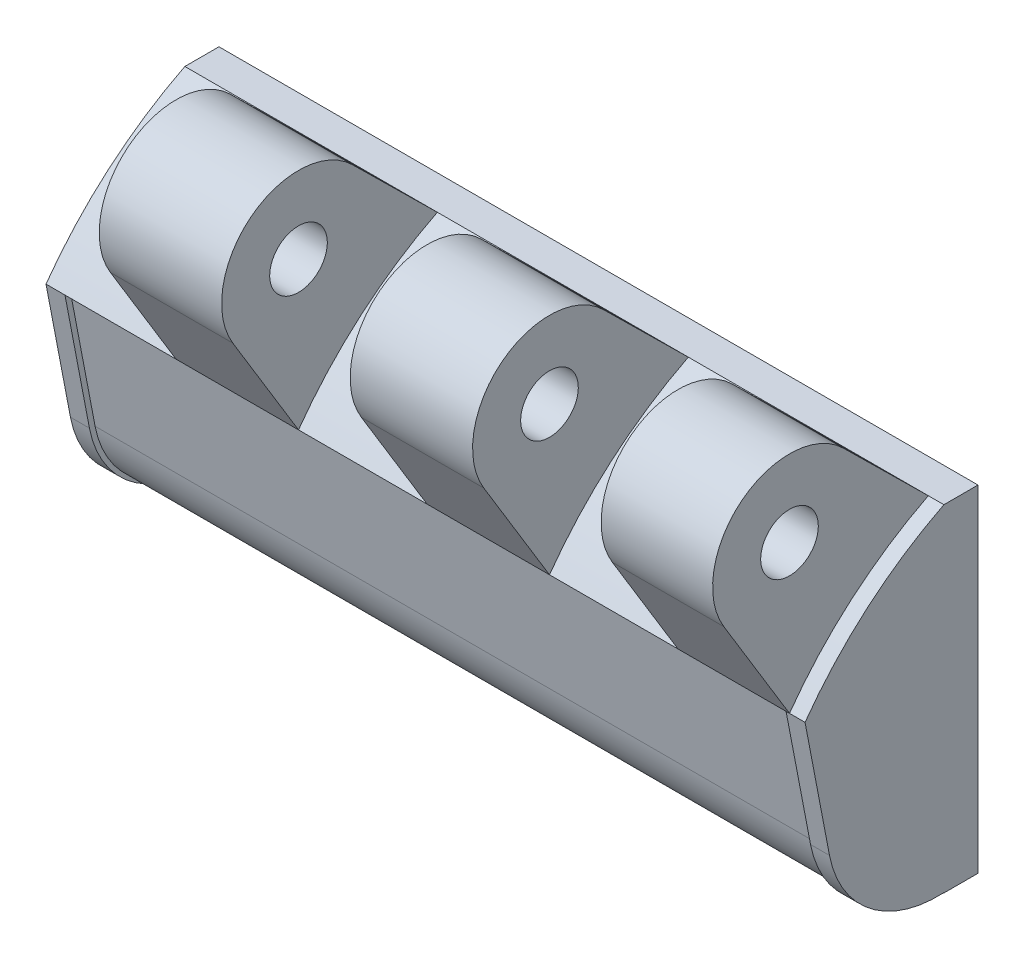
ISO-10303-21;
HEADER;
FILE_DESCRIPTION(('STEP AP214'),'2;1');
FILE_NAME('part.step','',(''),(''),'','','');
FILE_SCHEMA(('AUTOMOTIVE_DESIGN { 1 0 10303 214 1 1 1 1 }'));
ENDSEC;
DATA;
#1=APPLICATION_CONTEXT('core data for automotive mechanical design processes');
#2=APPLICATION_PROTOCOL_DEFINITION('international standard','automotive_design',2000,#1);
#3=PRODUCT_CONTEXT('',#1,'mechanical');
#4=PRODUCT('Part','Part','',(#3));
#5=PRODUCT_RELATED_PRODUCT_CATEGORY('part','',(#4));
#6=PRODUCT_DEFINITION_FORMATION('','',#4);
#7=PRODUCT_DEFINITION_CONTEXT('part definition',#1,'design');
#8=PRODUCT_DEFINITION('design','',#6,#7);
#9=PRODUCT_DEFINITION_SHAPE('','',#8);
#10=(LENGTH_UNIT() NAMED_UNIT(*) SI_UNIT(.MILLI.,.METRE.));
#11=(NAMED_UNIT(*) PLANE_ANGLE_UNIT() SI_UNIT($,.RADIAN.));
#12=(NAMED_UNIT(*) SI_UNIT($,.STERADIAN.) SOLID_ANGLE_UNIT());
#13=UNCERTAINTY_MEASURE_WITH_UNIT(LENGTH_MEASURE(1.E-05),#10,'distance_accuracy_value','');
#14=(GEOMETRIC_REPRESENTATION_CONTEXT(3) GLOBAL_UNCERTAINTY_ASSIGNED_CONTEXT((#13)) GLOBAL_UNIT_ASSIGNED_CONTEXT((#10,
#11,#12)) REPRESENTATION_CONTEXT('',''));
#15=CARTESIAN_POINT('',(0.,0.,0.));
#16=DIRECTION('',(0.,0.,1.));
#17=DIRECTION('',(1.,0.,0.));
#18=AXIS2_PLACEMENT_3D('',#15,#16,#17);
#19=CARTESIAN_POINT('',(31.16375,-1.60515291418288,6.5487345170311));
#20=DIRECTION('',(0.,-0.188359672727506,0.982100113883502));
#21=DIRECTION('',(0.,-0.982100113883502,-0.188359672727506));
#22=AXIS2_PLACEMENT_3D('',#19,#20,#21);
#23=PLANE('',#22);
#24=DIRECTION('',(-0.493242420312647,0.854320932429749,0.163852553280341));
#25=VECTOR('',#24,1.);
#26=CARTESIAN_POINT('',(24.1666486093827,-5.55659305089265,5.7908769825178));
#27=LINE('',#26,#25);
#28=CARTESIAN_POINT('',(21.8852835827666,-1.60515291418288,6.5487345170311));
#29=VERTEX_POINT('',#28);
#30=CARTESIAN_POINT('',(20.9585481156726,0.,6.85659119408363));
#31=VERTEX_POINT('',#30);
#32=EDGE_CURVE('E614',#29,#31,#27,.T.);
#33=ORIENTED_EDGE('',*,*,#32,.T.);
#34=DIRECTION('',(0.493242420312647,0.854320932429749,0.163852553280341));
#35=VECTOR('',#34,1.);
#36=CARTESIAN_POINT('',(22.7641050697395,3.12731638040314,7.45638777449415));
#37=LINE('',#36,#35);
#38=CARTESIAN_POINT('',(22.9792740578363,3.5,7.52786578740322));
#39=VERTEX_POINT('',#38);
#40=EDGE_CURVE('E602',#31,#39,#37,.T.);
#41=ORIENTED_EDGE('',*,*,#40,.T.);
#42=DIRECTION('',(1.,0.,0.));
#43=VECTOR('',#42,1.);
#44=CARTESIAN_POINT('',(31.2625,3.5,7.52786578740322));
#45=LINE('',#44,#43);
#46=CARTESIAN_POINT('',(27.0207259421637,3.5,7.52786578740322));
#47=VERTEX_POINT('',#46);
#48=EDGE_CURVE('E605',#39,#47,#45,.T.);
#49=ORIENTED_EDGE('',*,*,#48,.T.);
#50=DIRECTION('',(0.493242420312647,-0.854320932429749,-0.163852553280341));
#51=VECTOR('',#50,1.);
#52=CARTESIAN_POINT('',(30.2830781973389,-2.15055985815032,6.44412942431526));
#53=LINE('',#52,#51);
#54=CARTESIAN_POINT('',(29.0414518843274,0.,6.85659119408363));
#55=VERTEX_POINT('',#54);
#56=EDGE_CURVE('E608',#47,#55,#53,.T.);
#57=ORIENTED_EDGE('',*,*,#56,.T.);
#58=DIRECTION('',(-0.493242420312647,-0.854320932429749,-0.163852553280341));
#59=VECTOR('',#58,1.);
#60=CARTESIAN_POINT('',(28.8805346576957,-0.278716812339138,6.80313533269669));
#61=LINE('',#60,#59);
#62=CARTESIAN_POINT('',(28.1147164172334,-1.60515291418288,6.5487345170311));
#63=VERTEX_POINT('',#62);
#64=EDGE_CURVE('E611',#55,#63,#61,.T.);
#65=ORIENTED_EDGE('',*,*,#64,.T.);
#66=DIRECTION('',(-1.,0.,0.));
#67=VECTOR('',#66,1.);
#68=CARTESIAN_POINT('',(31.16375,-1.60515291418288,6.5487345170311));
#69=LINE('',#68,#67);
#70=EDGE_CURVE('E326',#63,#29,#69,.T.);
#71=ORIENTED_EDGE('',*,*,#70,.T.);
#72=EDGE_LOOP('',(#33,#41,#49,#57,#65,#71));
#73=FACE_BOUND('',#72,.T.);
#74=ADVANCED_FACE('F14',(#73),#23,.F.);
#75=CARTESIAN_POINT('',(31.16375,-0.75,2.09));
#76=DIRECTION('',(-1.,0.,0.));
#77=DIRECTION('',(0.,-1.,0.));
#78=AXIS2_PLACEMENT_3D('',#75,#76,#77);
#79=CYLINDRICAL_SURFACE('',#78,4.54);
#80=DIRECTION('',(-1.,0.,0.));
#81=VECTOR('',#80,1.);
#82=CARTESIAN_POINT('',(31.2625,-3.5,5.70235380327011));
#83=LINE('',#82,#81);
#84=CARTESIAN_POINT('',(22.9792740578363,-3.5,5.70235380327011));
#85=VERTEX_POINT('',#84);
#86=CARTESIAN_POINT('',(27.0207259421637,-3.5,5.70235380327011));
#87=VERTEX_POINT('',#86);
#88=EDGE_CURVE('E617',#85,#87,#83,.F.);
#89=ORIENTED_EDGE('',*,*,#88,.F.);
#90=CARTESIAN_POINT('',(21.3915608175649,-0.75,2.09));
#91=DIRECTION('',(0.866025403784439,0.5,0.));
#92=DIRECTION('',(-0.5,0.866025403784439,0.));
#93=AXIS2_PLACEMENT_3D('',#90,#91,#92);
#94=ELLIPSE('',#93,5.24234044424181,4.54);
#95=EDGE_CURVE('E404',#29,#85,#94,.T.);
#96=ORIENTED_EDGE('',*,*,#95,.F.);
#97=ORIENTED_EDGE('',*,*,#70,.F.);
#98=CARTESIAN_POINT('',(28.6084391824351,-0.75,2.09));
#99=DIRECTION('',(-0.866025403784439,0.5,0.));
#100=DIRECTION('',(-0.5,-0.866025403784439,0.));
#101=AXIS2_PLACEMENT_3D('',#98,#99,#100);
#102=ELLIPSE('',#101,5.24234044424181,4.54);
#103=EDGE_CURVE('E402',#87,#63,#102,.T.);
#104=ORIENTED_EDGE('',*,*,#103,.F.);
#105=EDGE_LOOP('',(#89,#96,#97,#104));
#106=FACE_BOUND('',#105,.T.);
#107=ADVANCED_FACE('F682',(#106),#79,.F.);
#108=DIRECTION('',(-0.493242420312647,0.854320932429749,0.163852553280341));
#109=VECTOR('',#108,1.);
#110=CARTESIAN_POINT('',(5.24885073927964,-16.0912761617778,3.77040123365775));
#111=LINE('',#110,#109);
#112=CARTESIAN_POINT('',(-3.1147164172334,-1.60515291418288,6.5487345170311));
#113=VERTEX_POINT('',#112);
#114=CARTESIAN_POINT('',(-4.0414518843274,0.,6.85659119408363));
#115=VERTEX_POINT('',#114);
#116=EDGE_CURVE('E22',#113,#115,#111,.T.);
#117=ORIENTED_EDGE('',*,*,#116,.T.);
#118=DIRECTION('',(0.493242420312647,0.854320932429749,0.163852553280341));
#119=VECTOR('',#118,1.);
#120=CARTESIAN_POINT('',(3.84630719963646,13.6619994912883,9.4768635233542));
#121=LINE('',#120,#119);
#122=CARTESIAN_POINT('',(-2.0207259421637,3.5,7.52786578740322));
#123=VERTEX_POINT('',#122);
#124=EDGE_CURVE('E619',#115,#123,#121,.T.);
#125=ORIENTED_EDGE('',*,*,#124,.T.);
#126=DIRECTION('',(1.,0.,0.));
#127=VECTOR('',#126,1.);
#128=CARTESIAN_POINT('',(31.2625,3.5,7.52786578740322));
#129=LINE('',#128,#127);
#130=CARTESIAN_POINT('',(2.0207259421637,3.5,7.52786578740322));
#131=VERTEX_POINT('',#130);
#132=EDGE_CURVE('E622',#123,#131,#129,.T.);
#133=ORIENTED_EDGE('',*,*,#132,.T.);
#134=DIRECTION('',(0.493242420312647,-0.854320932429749,-0.163852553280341));
#135=VECTOR('',#134,1.);
#136=CARTESIAN_POINT('',(11.3652803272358,-12.6852429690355,4.42365367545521));
#137=LINE('',#136,#135);
#138=CARTESIAN_POINT('',(4.04145188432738,0.,6.85659119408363));
#139=VERTEX_POINT('',#138);
#140=EDGE_CURVE('E625',#131,#139,#137,.T.);
#141=ORIENTED_EDGE('',*,*,#140,.T.);
#142=DIRECTION('',(-0.493242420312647,-0.854320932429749,-0.163852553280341));
#143=VECTOR('',#142,1.);
#144=CARTESIAN_POINT('',(9.96273678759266,10.255966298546,8.82361108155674));
#145=LINE('',#144,#143);
#146=CARTESIAN_POINT('',(3.11471641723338,-1.60515291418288,6.5487345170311));
#147=VERTEX_POINT('',#146);
#148=EDGE_CURVE('E628',#139,#147,#145,.T.);
#149=ORIENTED_EDGE('',*,*,#148,.T.);
#150=EDGE_CURVE('E635',#147,#113,#69,.T.);
#151=ORIENTED_EDGE('',*,*,#150,.T.);
#152=EDGE_LOOP('',(#117,#125,#133,#141,#149,#151));
#153=FACE_BOUND('',#152,.T.);
#154=ADVANCED_FACE('F633',(#153),#23,.F.);
#155=DIRECTION('',(-1.,0.,0.));
#156=VECTOR('',#155,1.);
#157=CARTESIAN_POINT('',(31.2625,-3.5,5.70235380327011));
#158=LINE('',#157,#156);
#159=CARTESIAN_POINT('',(-2.0207259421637,-3.5,5.70235380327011));
#160=VERTEX_POINT('',#159);
#161=CARTESIAN_POINT('',(2.0207259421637,-3.5,5.70235380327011));
#162=VERTEX_POINT('',#161);
#163=EDGE_CURVE('E9',#160,#162,#158,.F.);
#164=ORIENTED_EDGE('',*,*,#163,.F.);
#165=CARTESIAN_POINT('',(-3.60843918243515,-0.75,2.09));
#166=DIRECTION('',(0.866025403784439,0.5,0.));
#167=DIRECTION('',(-0.5,0.866025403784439,0.));
#168=AXIS2_PLACEMENT_3D('',#165,#166,#167);
#169=ELLIPSE('',#168,5.24234044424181,4.54);
#170=EDGE_CURVE('E364',#113,#160,#169,.T.);
#171=ORIENTED_EDGE('',*,*,#170,.F.);
#172=ORIENTED_EDGE('',*,*,#150,.F.);
#173=CARTESIAN_POINT('',(3.60843918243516,-0.75,2.09));
#174=DIRECTION('',(-0.866025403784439,0.5,0.));
#175=DIRECTION('',(-0.5,-0.866025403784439,0.));
#176=AXIS2_PLACEMENT_3D('',#173,#174,#175);
#177=ELLIPSE('',#176,5.24234044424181,4.54);
#178=EDGE_CURVE('E362',#162,#147,#177,.T.);
#179=ORIENTED_EDGE('',*,*,#178,.F.);
#180=EDGE_LOOP('',(#164,#171,#172,#179));
#181=FACE_BOUND('',#180,.T.);
#182=ADVANCED_FACE('F644',(#181),#79,.F.);
#183=CARTESIAN_POINT('',(22.9792740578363,3.5,8.57));
#184=DIRECTION('',(0.866025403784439,-0.5,0.));
#185=DIRECTION('',(0.5,0.866025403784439,0.));
#186=AXIS2_PLACEMENT_3D('',#183,#184,#185);
#187=PLANE('',#186);
#188=DIRECTION('',(0.,0.,-1.));
#189=VECTOR('',#188,1.);
#190=CARTESIAN_POINT('',(20.9585481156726,0.,8.57));
#191=LINE('',#190,#189);
#192=CARTESIAN_POINT('',(20.9585481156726,0.,2.2));
#193=VERTEX_POINT('',#192);
#194=EDGE_CURVE('E390',#31,#193,#191,.T.);
#195=ORIENTED_EDGE('',*,*,#194,.T.);
#196=DIRECTION('',(-0.5,-0.866025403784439,0.));
#197=VECTOR('',#196,1.);
#198=CARTESIAN_POINT('',(22.9792740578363,3.5,2.2));
#199=LINE('',#198,#197);
#200=CARTESIAN_POINT('',(22.9792740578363,3.5,2.2));
#201=VERTEX_POINT('',#200);
#202=EDGE_CURVE('E387',#201,#193,#199,.T.);
#203=ORIENTED_EDGE('',*,*,#202,.F.);
#204=DIRECTION('',(0.,0.,-1.));
#205=VECTOR('',#204,1.);
#206=CARTESIAN_POINT('',(22.9792740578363,3.5,8.57));
#207=LINE('',#206,#205);
#208=EDGE_CURVE('E392',#39,#201,#207,.T.);
#209=ORIENTED_EDGE('',*,*,#208,.F.);
#210=ORIENTED_EDGE('',*,*,#40,.F.);
#211=EDGE_LOOP('',(#195,#203,#209,#210));
#212=FACE_BOUND('',#211,.T.);
#213=ADVANCED_FACE('F697',(#212),#187,.T.);
#214=CARTESIAN_POINT('',(27.0207259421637,3.5,8.57));
#215=DIRECTION('',(0.,-1.,0.));
#216=DIRECTION('',(1.,0.,0.));
#217=AXIS2_PLACEMENT_3D('',#214,#215,#216);
#218=PLANE('',#217);
#219=ORIENTED_EDGE('',*,*,#208,.T.);
#220=DIRECTION('',(-1.,0.,0.));
#221=VECTOR('',#220,1.);
#222=CARTESIAN_POINT('',(27.0207259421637,3.5,2.2));
#223=LINE('',#222,#221);
#224=CARTESIAN_POINT('',(27.0207259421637,3.5,2.2));
#225=VERTEX_POINT('',#224);
#226=EDGE_CURVE('E384',#225,#201,#223,.T.);
#227=ORIENTED_EDGE('',*,*,#226,.F.);
#228=DIRECTION('',(0.,0.,-1.));
#229=VECTOR('',#228,1.);
#230=CARTESIAN_POINT('',(27.0207259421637,3.5,8.57));
#231=LINE('',#230,#229);
#232=EDGE_CURVE('E394',#47,#225,#231,.T.);
#233=ORIENTED_EDGE('',*,*,#232,.F.);
#234=ORIENTED_EDGE('',*,*,#48,.F.);
#235=EDGE_LOOP('',(#219,#227,#233,#234));
#236=FACE_BOUND('',#235,.T.);
#237=ADVANCED_FACE('F702',(#236),#218,.T.);
#238=CARTESIAN_POINT('',(29.0414518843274,0.,8.57));
#239=DIRECTION('',(-0.866025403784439,-0.5,0.));
#240=DIRECTION('',(0.5,-0.866025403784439,0.));
#241=AXIS2_PLACEMENT_3D('',#238,#239,#240);
#242=PLANE('',#241);
#243=ORIENTED_EDGE('',*,*,#232,.T.);
#244=DIRECTION('',(-0.5,0.866025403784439,0.));
#245=VECTOR('',#244,1.);
#246=CARTESIAN_POINT('',(29.0414518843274,0.,2.2));
#247=LINE('',#246,#245);
#248=CARTESIAN_POINT('',(29.0414518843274,0.,2.2));
#249=VERTEX_POINT('',#248);
#250=EDGE_CURVE('E381',#249,#225,#247,.T.);
#251=ORIENTED_EDGE('',*,*,#250,.F.);
#252=DIRECTION('',(0.,0.,-1.));
#253=VECTOR('',#252,1.);
#254=CARTESIAN_POINT('',(29.0414518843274,0.,8.57));
#255=LINE('',#254,#253);
#256=EDGE_CURVE('E396',#55,#249,#255,.T.);
#257=ORIENTED_EDGE('',*,*,#256,.F.);
#258=ORIENTED_EDGE('',*,*,#56,.F.);
#259=EDGE_LOOP('',(#243,#251,#257,#258));
#260=FACE_BOUND('',#259,.T.);
#261=ADVANCED_FACE('F853',(#260),#242,.T.);
#262=CARTESIAN_POINT('',(27.0207259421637,-3.5,8.57));
#263=DIRECTION('',(-0.866025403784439,0.5,0.));
#264=DIRECTION('',(-0.5,-0.866025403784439,0.));
#265=AXIS2_PLACEMENT_3D('',#262,#263,#264);
#266=PLANE('',#265);
#267=ORIENTED_EDGE('',*,*,#103,.T.);
#268=ORIENTED_EDGE('',*,*,#64,.F.);
#269=ORIENTED_EDGE('',*,*,#256,.T.);
#270=DIRECTION('',(0.5,0.866025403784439,0.));
#271=VECTOR('',#270,1.);
#272=CARTESIAN_POINT('',(27.0207259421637,-3.5,2.2));
#273=LINE('',#272,#271);
#274=CARTESIAN_POINT('',(27.0207259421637,-3.5,2.2));
#275=VERTEX_POINT('',#274);
#276=EDGE_CURVE('E378',#275,#249,#273,.T.);
#277=ORIENTED_EDGE('',*,*,#276,.F.);
#278=DIRECTION('',(0.,0.,-1.));
#279=VECTOR('',#278,1.);
#280=CARTESIAN_POINT('',(27.0207259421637,-3.5,8.57));
#281=LINE('',#280,#279);
#282=EDGE_CURVE('E398',#87,#275,#281,.T.);
#283=ORIENTED_EDGE('',*,*,#282,.F.);
#284=EDGE_LOOP('',(#267,#268,#269,#277,#283));
#285=FACE_BOUND('',#284,.T.);
#286=ADVANCED_FACE('F856',(#285),#266,.T.);
#287=CARTESIAN_POINT('',(22.9792740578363,-3.5,8.57));
#288=DIRECTION('',(0.,1.,0.));
#289=DIRECTION('',(-1.,0.,0.));
#290=AXIS2_PLACEMENT_3D('',#287,#288,#289);
#291=PLANE('',#290);
#292=ORIENTED_EDGE('',*,*,#88,.T.);
#293=ORIENTED_EDGE('',*,*,#282,.T.);
#294=DIRECTION('',(1.,0.,0.));
#295=VECTOR('',#294,1.);
#296=CARTESIAN_POINT('',(22.9792740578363,-3.5,2.2));
#297=LINE('',#296,#295);
#298=CARTESIAN_POINT('',(22.9792740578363,-3.5,2.2));
#299=VERTEX_POINT('',#298);
#300=EDGE_CURVE('E375',#299,#275,#297,.T.);
#301=ORIENTED_EDGE('',*,*,#300,.F.);
#302=DIRECTION('',(0.,0.,-1.));
#303=VECTOR('',#302,1.);
#304=CARTESIAN_POINT('',(22.9792740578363,-3.5,8.57));
#305=LINE('',#304,#303);
#306=EDGE_CURVE('E400',#85,#299,#305,.T.);
#307=ORIENTED_EDGE('',*,*,#306,.F.);
#308=EDGE_LOOP('',(#292,#293,#301,#307));
#309=FACE_BOUND('',#308,.T.);
#310=ADVANCED_FACE('F677',(#309),#291,.T.);
#311=CARTESIAN_POINT('',(20.9585481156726,0.,8.57));
#312=DIRECTION('',(0.866025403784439,0.5,0.));
#313=DIRECTION('',(-0.5,0.866025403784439,0.));
#314=AXIS2_PLACEMENT_3D('',#311,#312,#313);
#315=PLANE('',#314);
#316=ORIENTED_EDGE('',*,*,#95,.T.);
#317=ORIENTED_EDGE('',*,*,#306,.T.);
#318=DIRECTION('',(0.5,-0.866025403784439,0.));
#319=VECTOR('',#318,1.);
#320=CARTESIAN_POINT('',(20.9585481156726,0.,2.2));
#321=LINE('',#320,#319);
#322=EDGE_CURVE('E372',#193,#299,#321,.T.);
#323=ORIENTED_EDGE('',*,*,#322,.F.);
#324=ORIENTED_EDGE('',*,*,#194,.F.);
#325=ORIENTED_EDGE('',*,*,#32,.F.);
#326=EDGE_LOOP('',(#316,#317,#323,#324,#325));
#327=FACE_BOUND('',#326,.T.);
#328=ADVANCED_FACE('F668',(#327),#315,.T.);
#329=CARTESIAN_POINT('',(-2.0207259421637,3.5,8.57));
#330=DIRECTION('',(0.866025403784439,-0.5,0.));
#331=DIRECTION('',(0.5,0.866025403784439,0.));
#332=AXIS2_PLACEMENT_3D('',#329,#330,#331);
#333=PLANE('',#332);
#334=DIRECTION('',(0.,0.,-1.));
#335=VECTOR('',#334,1.);
#336=CARTESIAN_POINT('',(-4.0414518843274,0.,8.57));
#337=LINE('',#336,#335);
#338=CARTESIAN_POINT('',(-4.0414518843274,0.,2.2));
#339=VERTEX_POINT('',#338);
#340=EDGE_CURVE('E350',#115,#339,#337,.T.);
#341=ORIENTED_EDGE('',*,*,#340,.T.);
#342=DIRECTION('',(-0.5,-0.866025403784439,0.));
#343=VECTOR('',#342,1.);
#344=CARTESIAN_POINT('',(-2.0207259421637,3.5,2.2));
#345=LINE('',#344,#343);
#346=CARTESIAN_POINT('',(-2.0207259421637,3.5,2.2));
#347=VERTEX_POINT('',#346);
#348=EDGE_CURVE('E347',#347,#339,#345,.T.);
#349=ORIENTED_EDGE('',*,*,#348,.F.);
#350=DIRECTION('',(0.,0.,-1.));
#351=VECTOR('',#350,1.);
#352=CARTESIAN_POINT('',(-2.0207259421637,3.5,8.57));
#353=LINE('',#352,#351);
#354=EDGE_CURVE('E352',#123,#347,#353,.T.);
#355=ORIENTED_EDGE('',*,*,#354,.F.);
#356=ORIENTED_EDGE('',*,*,#124,.F.);
#357=EDGE_LOOP('',(#341,#349,#355,#356));
#358=FACE_BOUND('',#357,.T.);
#359=ADVANCED_FACE('F666',(#358),#333,.T.);
#360=CARTESIAN_POINT('',(2.0207259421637,3.5,8.57));
#361=DIRECTION('',(0.,-1.,0.));
#362=DIRECTION('',(1.,0.,0.));
#363=AXIS2_PLACEMENT_3D('',#360,#361,#362);
#364=PLANE('',#363);
#365=ORIENTED_EDGE('',*,*,#354,.T.);
#366=DIRECTION('',(-1.,0.,0.));
#367=VECTOR('',#366,1.);
#368=CARTESIAN_POINT('',(2.0207259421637,3.5,2.2));
#369=LINE('',#368,#367);
#370=CARTESIAN_POINT('',(2.0207259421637,3.5,2.2));
#371=VERTEX_POINT('',#370);
#372=EDGE_CURVE('E344',#371,#347,#369,.T.);
#373=ORIENTED_EDGE('',*,*,#372,.F.);
#374=DIRECTION('',(0.,0.,-1.));
#375=VECTOR('',#374,1.);
#376=CARTESIAN_POINT('',(2.0207259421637,3.5,8.57));
#377=LINE('',#376,#375);
#378=EDGE_CURVE('E354',#131,#371,#377,.T.);
#379=ORIENTED_EDGE('',*,*,#378,.F.);
#380=ORIENTED_EDGE('',*,*,#132,.F.);
#381=EDGE_LOOP('',(#365,#373,#379,#380));
#382=FACE_BOUND('',#381,.T.);
#383=ADVANCED_FACE('F662',(#382),#364,.T.);
#384=CARTESIAN_POINT('',(4.04145188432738,0.,8.57));
#385=DIRECTION('',(-0.866025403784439,-0.5,0.));
#386=DIRECTION('',(0.5,-0.866025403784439,0.));
#387=AXIS2_PLACEMENT_3D('',#384,#385,#386);
#388=PLANE('',#387);
#389=ORIENTED_EDGE('',*,*,#378,.T.);
#390=DIRECTION('',(-0.5,0.866025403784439,0.));
#391=VECTOR('',#390,1.);
#392=CARTESIAN_POINT('',(4.04145188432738,0.,2.2));
#393=LINE('',#392,#391);
#394=CARTESIAN_POINT('',(4.04145188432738,0.,2.2));
#395=VERTEX_POINT('',#394);
#396=EDGE_CURVE('E341',#395,#371,#393,.T.);
#397=ORIENTED_EDGE('',*,*,#396,.F.);
#398=DIRECTION('',(0.,0.,-1.));
#399=VECTOR('',#398,1.);
#400=CARTESIAN_POINT('',(4.04145188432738,0.,8.57));
#401=LINE('',#400,#399);
#402=EDGE_CURVE('E356',#139,#395,#401,.T.);
#403=ORIENTED_EDGE('',*,*,#402,.F.);
#404=ORIENTED_EDGE('',*,*,#140,.F.);
#405=EDGE_LOOP('',(#389,#397,#403,#404));
#406=FACE_BOUND('',#405,.T.);
#407=ADVANCED_FACE('F659',(#406),#388,.T.);
#408=CARTESIAN_POINT('',(2.0207259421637,-3.5,8.57));
#409=DIRECTION('',(-0.866025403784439,0.5,0.));
#410=DIRECTION('',(-0.5,-0.866025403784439,0.));
#411=AXIS2_PLACEMENT_3D('',#408,#409,#410);
#412=PLANE('',#411);
#413=ORIENTED_EDGE('',*,*,#178,.T.);
#414=ORIENTED_EDGE('',*,*,#148,.F.);
#415=ORIENTED_EDGE('',*,*,#402,.T.);
#416=DIRECTION('',(0.5,0.866025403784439,0.));
#417=VECTOR('',#416,1.);
#418=CARTESIAN_POINT('',(2.0207259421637,-3.5,2.2));
#419=LINE('',#418,#417);
#420=CARTESIAN_POINT('',(2.0207259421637,-3.5,2.2));
#421=VERTEX_POINT('',#420);
#422=EDGE_CURVE('E338',#421,#395,#419,.T.);
#423=ORIENTED_EDGE('',*,*,#422,.F.);
#424=DIRECTION('',(0.,0.,-1.));
#425=VECTOR('',#424,1.);
#426=CARTESIAN_POINT('',(2.0207259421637,-3.5,8.57));
#427=LINE('',#426,#425);
#428=EDGE_CURVE('E358',#162,#421,#427,.T.);
#429=ORIENTED_EDGE('',*,*,#428,.F.);
#430=EDGE_LOOP('',(#413,#414,#415,#423,#429));
#431=FACE_BOUND('',#430,.T.);
#432=ADVANCED_FACE('F652',(#431),#412,.T.);
#433=CARTESIAN_POINT('',(-2.0207259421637,-3.5,8.57));
#434=DIRECTION('',(0.,1.,0.));
#435=DIRECTION('',(-1.,0.,0.));
#436=AXIS2_PLACEMENT_3D('',#433,#434,#435);
#437=PLANE('',#436);
#438=ORIENTED_EDGE('',*,*,#163,.T.);
#439=ORIENTED_EDGE('',*,*,#428,.T.);
#440=DIRECTION('',(1.,0.,0.));
#441=VECTOR('',#440,1.);
#442=CARTESIAN_POINT('',(-2.0207259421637,-3.5,2.2));
#443=LINE('',#442,#441);
#444=CARTESIAN_POINT('',(-2.0207259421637,-3.5,2.2));
#445=VERTEX_POINT('',#444);
#446=EDGE_CURVE('E335',#445,#421,#443,.T.);
#447=ORIENTED_EDGE('',*,*,#446,.F.);
#448=DIRECTION('',(0.,0.,-1.));
#449=VECTOR('',#448,1.);
#450=CARTESIAN_POINT('',(-2.0207259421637,-3.5,8.57));
#451=LINE('',#450,#449);
#452=EDGE_CURVE('E360',#160,#445,#451,.T.);
#453=ORIENTED_EDGE('',*,*,#452,.F.);
#454=EDGE_LOOP('',(#438,#439,#447,#453));
#455=FACE_BOUND('',#454,.T.);
#456=ADVANCED_FACE('F648',(#455),#437,.T.);
#457=CARTESIAN_POINT('',(-4.0414518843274,0.,8.57));
#458=DIRECTION('',(0.866025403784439,0.5,0.));
#459=DIRECTION('',(-0.5,0.866025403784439,0.));
#460=AXIS2_PLACEMENT_3D('',#457,#458,#459);
#461=PLANE('',#460);
#462=ORIENTED_EDGE('',*,*,#170,.T.);
#463=ORIENTED_EDGE('',*,*,#452,.T.);
#464=DIRECTION('',(0.5,-0.866025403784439,0.));
#465=VECTOR('',#464,1.);
#466=CARTESIAN_POINT('',(-4.0414518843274,0.,2.2));
#467=LINE('',#466,#465);
#468=EDGE_CURVE('E332',#339,#445,#467,.T.);
#469=ORIENTED_EDGE('',*,*,#468,.F.);
#470=ORIENTED_EDGE('',*,*,#340,.F.);
#471=ORIENTED_EDGE('',*,*,#116,.F.);
#472=EDGE_LOOP('',(#462,#463,#469,#470,#471));
#473=FACE_BOUND('',#472,.T.);
#474=ADVANCED_FACE('F639',(#473),#461,.T.);
#475=CARTESIAN_POINT('',(12.5,12.5,2.2));
#476=DIRECTION('',(0.,0.,1.));
#477=DIRECTION('',(1.,0.,0.));
#478=AXIS2_PLACEMENT_3D('',#475,#476,#477);
#479=PLANE('',#478);
#480=CARTESIAN_POINT('',(25.,0.,2.2));
#481=DIRECTION('',(0.,0.,1.));
#482=DIRECTION('',(0.,1.,0.));
#483=AXIS2_PLACEMENT_3D('',#480,#481,#482);
#484=CIRCLE('',#483,2.25);
#485=CARTESIAN_POINT('',(25.,2.25,2.2));
#486=VERTEX_POINT('',#485);
#487=EDGE_CURVE('E366',#486,#486,#484,.T.);
#488=ORIENTED_EDGE('',*,*,#487,.F.);
#489=EDGE_LOOP('',(#488));
#490=FACE_BOUND('',#489,.T.);
#491=ORIENTED_EDGE('',*,*,#322,.T.);
#492=ORIENTED_EDGE('',*,*,#300,.T.);
#493=ORIENTED_EDGE('',*,*,#276,.T.);
#494=ORIENTED_EDGE('',*,*,#250,.T.);
#495=ORIENTED_EDGE('',*,*,#226,.T.);
#496=ORIENTED_EDGE('',*,*,#202,.T.);
#497=EDGE_LOOP('',(#491,#492,#493,#494,#495,#496));
#498=FACE_BOUND('',#497,.T.);
#499=ADVANCED_FACE('F719',(#490,#498),#479,.T.);
#500=CARTESIAN_POINT('',(12.5,12.5,2.2));
#501=DIRECTION('',(0.,0.,1.));
#502=DIRECTION('',(1.,0.,0.));
#503=AXIS2_PLACEMENT_3D('',#500,#501,#502);
#504=PLANE('',#503);
#505=CARTESIAN_POINT('',(0.,0.,2.2));
#506=DIRECTION('',(0.,0.,1.));
#507=DIRECTION('',(0.,1.,0.));
#508=AXIS2_PLACEMENT_3D('',#505,#506,#507);
#509=CIRCLE('',#508,2.25);
#510=CARTESIAN_POINT('',(0.,2.25,2.2));
#511=VERTEX_POINT('',#510);
#512=EDGE_CURVE('E321',#511,#511,#509,.T.);
#513=ORIENTED_EDGE('',*,*,#512,.F.);
#514=EDGE_LOOP('',(#513));
#515=FACE_BOUND('',#514,.T.);
#516=ORIENTED_EDGE('',*,*,#468,.T.);
#517=ORIENTED_EDGE('',*,*,#446,.T.);
#518=ORIENTED_EDGE('',*,*,#422,.T.);
#519=ORIENTED_EDGE('',*,*,#396,.T.);
#520=ORIENTED_EDGE('',*,*,#372,.T.);
#521=ORIENTED_EDGE('',*,*,#348,.T.);
#522=EDGE_LOOP('',(#516,#517,#518,#519,#520,#521));
#523=FACE_BOUND('',#522,.T.);
#524=ADVANCED_FACE('F656',(#515,#523),#504,.T.);
#525=CARTESIAN_POINT('',(31.2625,-0.75,2.09));
#526=DIRECTION('',(-1.,0.,0.));
#527=DIRECTION('',(0.,-1.,0.));
#528=AXIS2_PLACEMENT_3D('',#525,#526,#527);
#529=CYLINDRICAL_SURFACE('',#528,4.54);
#530=CARTESIAN_POINT('',(-6.16375,-0.75,2.09));
#531=DIRECTION('',(1.,0.,0.));
#532=DIRECTION('',(0.,1.,0.));
#533=AXIS2_PLACEMENT_3D('',#530,#531,#532);
#534=CIRCLE('',#533,4.54);
#535=CARTESIAN_POINT('',(-6.16375,-1.60515291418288,6.5487345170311));
#536=VERTEX_POINT('',#535);
#537=CARTESIAN_POINT('',(-6.16375,-5.27902244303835,1.77447549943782));
#538=VERTEX_POINT('',#537);
#539=EDGE_CURVE('E821',#536,#538,#534,.T.);
#540=ORIENTED_EDGE('',*,*,#539,.F.);
#541=DIRECTION('',(-1.,0.,0.));
#542=VECTOR('',#541,1.);
#543=CARTESIAN_POINT('',(31.2625,-1.60515291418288,6.5487345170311));
#544=LINE('',#543,#542);
#545=CARTESIAN_POINT('',(-6.2625,-1.60515291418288,6.5487345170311));
#546=VERTEX_POINT('',#545);
#547=EDGE_CURVE('E518',#536,#546,#544,.T.);
#548=ORIENTED_EDGE('',*,*,#547,.T.);
#549=CARTESIAN_POINT('',(-6.2625,-0.75,2.09));
#550=DIRECTION('',(1.,0.,0.));
#551=DIRECTION('',(0.,1.,0.));
#552=AXIS2_PLACEMENT_3D('',#549,#550,#551);
#553=CIRCLE('',#552,4.54);
#554=CARTESIAN_POINT('',(-6.2625,-5.27902244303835,1.77447549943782));
#555=VERTEX_POINT('',#554);
#556=EDGE_CURVE('E507',#546,#555,#553,.T.);
#557=ORIENTED_EDGE('',*,*,#556,.T.);
#558=DIRECTION('',(-1.,0.,0.));
#559=VECTOR('',#558,1.);
#560=CARTESIAN_POINT('',(31.2625,-5.27902244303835,1.77447549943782));
#561=LINE('',#560,#559);
#562=EDGE_CURVE('E522',#538,#555,#561,.T.);
#563=ORIENTED_EDGE('',*,*,#562,.F.);
#564=EDGE_LOOP('',(#540,#548,#557,#563));
#565=FACE_BOUND('',#564,.T.);
#566=ADVANCED_FACE('F718',(#565),#529,.T.);
#567=CARTESIAN_POINT('',(31.2625,-1.60515291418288,6.5487345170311));
#568=VERTEX_POINT('',#567);
#569=CARTESIAN_POINT('',(31.16375,-1.60515291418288,6.5487345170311));
#570=VERTEX_POINT('',#569);
#571=EDGE_CURVE('E519',#568,#570,#544,.T.);
#572=ORIENTED_EDGE('',*,*,#571,.T.);
#573=CARTESIAN_POINT('',(31.16375,-0.75,2.09));
#574=DIRECTION('',(1.,0.,0.));
#575=DIRECTION('',(0.,1.,0.));
#576=AXIS2_PLACEMENT_3D('',#573,#574,#575);
#577=CIRCLE('',#576,4.54);
#578=CARTESIAN_POINT('',(31.16375,-5.27902244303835,1.77447549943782));
#579=VERTEX_POINT('',#578);
#580=EDGE_CURVE('E1379',#570,#579,#577,.T.);
#581=ORIENTED_EDGE('',*,*,#580,.T.);
#582=CARTESIAN_POINT('',(31.2625,-5.27902244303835,1.77447549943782));
#583=VERTEX_POINT('',#582);
#584=EDGE_CURVE('E523',#583,#579,#561,.T.);
#585=ORIENTED_EDGE('',*,*,#584,.F.);
#586=CARTESIAN_POINT('',(31.2625,-0.75,2.09));
#587=DIRECTION('',(1.,0.,0.));
#588=DIRECTION('',(0.,1.,0.));
#589=AXIS2_PLACEMENT_3D('',#586,#587,#588);
#590=CIRCLE('',#589,4.54);
#591=EDGE_CURVE('E495',#568,#583,#590,.T.);
#592=ORIENTED_EDGE('',*,*,#591,.F.);
#593=EDGE_LOOP('',(#572,#581,#585,#592));
#594=FACE_BOUND('',#593,.T.);
#595=ADVANCED_FACE('F709',(#594),#529,.T.);
#596=CARTESIAN_POINT('',(31.16375,-0.75,2.09));
#597=DIRECTION('',(-1.,0.,0.));
#598=DIRECTION('',(0.,-1.,0.));
#599=AXIS2_PLACEMENT_3D('',#596,#597,#598);
#600=CYLINDRICAL_SURFACE('',#599,5.54);
#601=CARTESIAN_POINT('',(-6.16375,-0.75,2.09));
#602=DIRECTION('',(1.,0.,0.));
#603=DIRECTION('',(0.,1.,0.));
#604=AXIS2_PLACEMENT_3D('',#601,#602,#603);
#605=CIRCLE('',#604,5.54);
#606=CARTESIAN_POINT('',(-6.16375,-1.7935125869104,7.5308346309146));
#607=VERTEX_POINT('',#606);
#608=CARTESIAN_POINT('',(-6.16375,-6.2810075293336,1.77447549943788));
#609=VERTEX_POINT('',#608);
#610=EDGE_CURVE('E1388',#607,#609,#605,.T.);
#611=ORIENTED_EDGE('',*,*,#610,.T.);
#612=DIRECTION('',(-1.,0.,0.));
#613=VECTOR('',#612,1.);
#614=CARTESIAN_POINT('',(31.16375,-6.2810075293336,1.77447549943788));
#615=LINE('',#614,#613);
#616=CARTESIAN_POINT('',(31.16375,-6.2810075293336,1.77447549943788));
#617=VERTEX_POINT('',#616);
#618=EDGE_CURVE('E306',#617,#609,#615,.T.);
#619=ORIENTED_EDGE('',*,*,#618,.F.);
#620=CARTESIAN_POINT('',(31.16375,-0.75,2.09));
#621=DIRECTION('',(1.,0.,0.));
#622=DIRECTION('',(0.,1.,0.));
#623=AXIS2_PLACEMENT_3D('',#620,#621,#622);
#624=CIRCLE('',#623,5.54);
#625=CARTESIAN_POINT('',(31.16375,-1.7935125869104,7.5308346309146));
#626=VERTEX_POINT('',#625);
#627=EDGE_CURVE('E300',#626,#617,#624,.T.);
#628=ORIENTED_EDGE('',*,*,#627,.F.);
#629=DIRECTION('',(-1.,0.,0.));
#630=VECTOR('',#629,1.);
#631=CARTESIAN_POINT('',(31.16375,-1.7935125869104,7.5308346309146));
#632=LINE('',#631,#630);
#633=EDGE_CURVE('E304',#626,#607,#632,.T.);
#634=ORIENTED_EDGE('',*,*,#633,.T.);
#635=EDGE_LOOP('',(#611,#619,#628,#634));
#636=FACE_BOUND('',#635,.T.);
#637=ADVANCED_FACE('F302',(#636),#600,.T.);
#638=CARTESIAN_POINT('',(25.,0.,-4.17));
#639=DIRECTION('',(0.,0.,1.));
#640=DIRECTION('',(1.,0.,0.));
#641=AXIS2_PLACEMENT_3D('',#638,#639,#640);
#642=CYLINDRICAL_SURFACE('',#641,2.25);
#643=ORIENTED_EDGE('',*,*,#487,.T.);
#644=EDGE_LOOP('',(#643));
#645=FACE_BOUND('',#644,.T.);
#646=CARTESIAN_POINT('',(25.,0.,0.));
#647=DIRECTION('',(0.,0.,1.));
#648=DIRECTION('',(1.,0.,0.));
#649=AXIS2_PLACEMENT_3D('',#646,#647,#648);
#650=CIRCLE('',#649,2.25);
#651=CARTESIAN_POINT('',(27.25,0.,0.));
#652=VERTEX_POINT('',#651);
#653=EDGE_CURVE('E369',#652,#652,#650,.T.);
#654=ORIENTED_EDGE('',*,*,#653,.F.);
#655=EDGE_LOOP('',(#654));
#656=FACE_BOUND('',#655,.T.);
#657=ADVANCED_FACE('F708',(#645,#656),#642,.F.);
#658=CARTESIAN_POINT('',(0.,0.,-4.17));
#659=DIRECTION('',(0.,0.,1.));
#660=DIRECTION('',(1.,0.,0.));
#661=AXIS2_PLACEMENT_3D('',#658,#659,#660);
#662=CYLINDRICAL_SURFACE('',#661,2.25);
#663=ORIENTED_EDGE('',*,*,#512,.T.);
#664=EDGE_LOOP('',(#663));
#665=FACE_BOUND('',#664,.T.);
#666=CARTESIAN_POINT('',(0.,0.,0.));
#667=DIRECTION('',(0.,0.,1.));
#668=DIRECTION('',(1.,0.,0.));
#669=AXIS2_PLACEMENT_3D('',#666,#667,#668);
#670=CIRCLE('',#669,2.25);
#671=CARTESIAN_POINT('',(2.25,0.,0.));
#672=VERTEX_POINT('',#671);
#673=EDGE_CURVE('E324',#672,#672,#670,.T.);
#674=ORIENTED_EDGE('',*,*,#673,.F.);
#675=EDGE_LOOP('',(#674));
#676=FACE_BOUND('',#675,.T.);
#677=ADVANCED_FACE('F713',(#665,#676),#662,.F.);
#678=CARTESIAN_POINT('',(32.25,-0.75,2.09));
#679=DIRECTION('',(-1.,0.,0.));
#680=DIRECTION('',(0.,-1.,0.));
#681=AXIS2_PLACEMENT_3D('',#678,#679,#680);
#682=CYLINDRICAL_SURFACE('',#681,5.74);
#683=DIRECTION('',(-1.,0.,0.));
#684=VECTOR('',#683,1.);
#685=CARTESIAN_POINT('',(32.25,-1.8311845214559,7.7272546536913));
#686=LINE('',#685,#684);
#687=CARTESIAN_POINT('',(32.25,-1.8311845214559,7.7272546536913));
#688=VERTEX_POINT('',#687);
#689=CARTESIAN_POINT('',(31.2625,-1.8311845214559,7.7272546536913));
#690=VERTEX_POINT('',#689);
#691=EDGE_CURVE('E578',#688,#690,#686,.T.);
#692=ORIENTED_EDGE('',*,*,#691,.T.);
#693=CARTESIAN_POINT('',(31.2625,-0.75,2.09));
#694=DIRECTION('',(1.,0.,0.));
#695=DIRECTION('',(0.,1.,0.));
#696=AXIS2_PLACEMENT_3D('',#693,#694,#695);
#697=CIRCLE('',#696,5.74);
#698=CARTESIAN_POINT('',(31.2625,-6.4813213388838,1.77447549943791));
#699=VERTEX_POINT('',#698);
#700=EDGE_CURVE('E530',#690,#699,#697,.T.);
#701=ORIENTED_EDGE('',*,*,#700,.T.);
#702=DIRECTION('',(-1.,0.,0.));
#703=VECTOR('',#702,1.);
#704=CARTESIAN_POINT('',(32.25,-6.4813213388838,1.77447549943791));
#705=LINE('',#704,#703);
#706=CARTESIAN_POINT('',(32.25,-6.4813213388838,1.77447549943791));
#707=VERTEX_POINT('',#706);
#708=EDGE_CURVE('E574',#707,#699,#705,.T.);
#709=ORIENTED_EDGE('',*,*,#708,.F.);
#710=CARTESIAN_POINT('',(32.25,-0.75,2.09));
#711=DIRECTION('',(1.,0.,0.));
#712=DIRECTION('',(0.,1.,0.));
#713=AXIS2_PLACEMENT_3D('',#710,#711,#712);
#714=CIRCLE('',#713,5.74);
#715=EDGE_CURVE('E549',#688,#707,#714,.T.);
#716=ORIENTED_EDGE('',*,*,#715,.F.);
#717=EDGE_LOOP('',(#692,#701,#709,#716));
#718=FACE_BOUND('',#717,.T.);
#719=ADVANCED_FACE('F715',(#718),#682,.T.);
#720=CARTESIAN_POINT('',(-6.2625,-0.75,2.09));
#721=DIRECTION('',(1.,0.,0.));
#722=DIRECTION('',(0.,1.,0.));
#723=AXIS2_PLACEMENT_3D('',#720,#721,#722);
#724=CIRCLE('',#723,5.74);
#725=CARTESIAN_POINT('',(-6.2625,-1.8311845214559,7.7272546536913));
#726=VERTEX_POINT('',#725);
#727=CARTESIAN_POINT('',(-6.2625,-6.4813213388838,1.77447549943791));
#728=VERTEX_POINT('',#727);
#729=EDGE_CURVE('E526',#726,#728,#724,.T.);
#730=ORIENTED_EDGE('',*,*,#729,.F.);
#731=CARTESIAN_POINT('',(-7.25,-1.8311845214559,7.7272546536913));
#732=VERTEX_POINT('',#731);
#733=EDGE_CURVE('E577',#726,#732,#686,.T.);
#734=ORIENTED_EDGE('',*,*,#733,.T.);
#735=CARTESIAN_POINT('',(-7.25,-0.75,2.09));
#736=DIRECTION('',(1.,0.,0.));
#737=DIRECTION('',(0.,1.,0.));
#738=AXIS2_PLACEMENT_3D('',#735,#736,#737);
#739=CIRCLE('',#738,5.74);
#740=CARTESIAN_POINT('',(-7.25,-6.4813213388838,1.77447549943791));
#741=VERTEX_POINT('',#740);
#742=EDGE_CURVE('E567',#732,#741,#739,.T.);
#743=ORIENTED_EDGE('',*,*,#742,.T.);
#744=EDGE_CURVE('E573',#728,#741,#705,.T.);
#745=ORIENTED_EDGE('',*,*,#744,.F.);
#746=EDGE_LOOP('',(#730,#734,#743,#745));
#747=FACE_BOUND('',#746,.T.);
#748=ADVANCED_FACE('F810',(#747),#682,.T.);
#749=CARTESIAN_POINT('',(32.25,-6.4813213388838,1.77447549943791));
#750=DIRECTION('',(0.,0.,-1.));
#751=DIRECTION('',(0.,1.,0.));
#752=AXIS2_PLACEMENT_3D('',#749,#750,#751);
#753=PLANE('',#752);
#754=ORIENTED_EDGE('',*,*,#584,.T.);
#755=DIRECTION('',(0.,1.,0.));
#756=VECTOR('',#755,1.);
#757=CARTESIAN_POINT('',(31.16375,-6.2810075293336,1.77447549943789));
#758=LINE('',#757,#756);
#759=EDGE_CURVE('E309',#617,#579,#758,.T.);
#760=ORIENTED_EDGE('',*,*,#759,.F.);
#761=ORIENTED_EDGE('',*,*,#618,.T.);
#762=DIRECTION('',(0.,1.,0.));
#763=VECTOR('',#762,1.);
#764=CARTESIAN_POINT('',(-6.16375,-6.2810075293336,1.77447549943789));
#765=LINE('',#764,#763);
#766=EDGE_CURVE('E1391',#609,#538,#765,.T.);
#767=ORIENTED_EDGE('',*,*,#766,.T.);
#768=ORIENTED_EDGE('',*,*,#562,.T.);
#769=DIRECTION('',(0.,1.,0.));
#770=VECTOR('',#769,1.);
#771=CARTESIAN_POINT('',(-6.2625,-7.4813213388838,1.77447549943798));
#772=LINE('',#771,#770);
#773=EDGE_CURVE('E492',#728,#555,#772,.T.);
#774=ORIENTED_EDGE('',*,*,#773,.F.);
#775=ORIENTED_EDGE('',*,*,#744,.T.);
#776=DIRECTION('',(0.,-1.,0.));
#777=VECTOR('',#776,1.);
#778=CARTESIAN_POINT('',(-7.25,-6.4813213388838,1.77447549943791));
#779=LINE('',#778,#777);
#780=CARTESIAN_POINT('',(-7.25,-6.5,1.77447549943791));
#781=VERTEX_POINT('',#780);
#782=EDGE_CURVE('E541',#741,#781,#779,.T.);
#783=ORIENTED_EDGE('',*,*,#782,.T.);
#784=DIRECTION('',(-1.,0.,0.));
#785=VECTOR('',#784,1.);
#786=CARTESIAN_POINT('',(32.25,-6.5,1.77447549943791));
#787=LINE('',#786,#785);
#788=CARTESIAN_POINT('',(32.25,-6.5,1.77447549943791));
#789=VERTEX_POINT('',#788);
#790=EDGE_CURVE('E553',#789,#781,#787,.T.);
#791=ORIENTED_EDGE('',*,*,#790,.F.);
#792=DIRECTION('',(0.,-1.,0.));
#793=VECTOR('',#792,1.);
#794=CARTESIAN_POINT('',(32.25,-6.4813213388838,1.77447549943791));
#795=LINE('',#794,#793);
#796=EDGE_CURVE('E551',#707,#789,#795,.T.);
#797=ORIENTED_EDGE('',*,*,#796,.F.);
#798=ORIENTED_EDGE('',*,*,#708,.T.);
#799=DIRECTION('',(0.,1.,0.));
#800=VECTOR('',#799,1.);
#801=CARTESIAN_POINT('',(31.2625,-7.4813213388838,1.77447549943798));
#802=LINE('',#801,#800);
#803=EDGE_CURVE('E493',#699,#583,#802,.T.);
#804=ORIENTED_EDGE('',*,*,#803,.T.);
#805=EDGE_LOOP('',(#754,#760,#761,#767,#768,#774,#775,#783,#791,#797,#798,#804));
#806=FACE_BOUND('',#805,.T.);
#807=ADVANCED_FACE('F813',(#806),#753,.F.);
#808=CARTESIAN_POINT('',(32.25,-6.5,1.77447549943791));
#809=DIRECTION('',(0.,1.,0.));
#810=DIRECTION('',(-1.,0.,0.));
#811=AXIS2_PLACEMENT_3D('',#808,#809,#810);
#812=PLANE('',#811);
#813=DIRECTION('',(0.,0.,-1.));
#814=VECTOR('',#813,1.);
#815=CARTESIAN_POINT('',(-7.25,-6.5,1.77447549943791));
#816=LINE('',#815,#814);
#817=CARTESIAN_POINT('',(-7.25,-6.5,0.));
#818=VERTEX_POINT('',#817);
#819=EDGE_CURVE('E536',#781,#818,#816,.T.);
#820=ORIENTED_EDGE('',*,*,#819,.T.);
#821=DIRECTION('',(-1.,0.,0.));
#822=VECTOR('',#821,1.);
#823=CARTESIAN_POINT('',(32.25,-6.5,0.));
#824=LINE('',#823,#822);
#825=CARTESIAN_POINT('',(32.25,-6.5,0.));
#826=VERTEX_POINT('',#825);
#827=EDGE_CURVE('E596',#826,#818,#824,.T.);
#828=ORIENTED_EDGE('',*,*,#827,.F.);
#829=DIRECTION('',(0.,0.,-1.));
#830=VECTOR('',#829,1.);
#831=CARTESIAN_POINT('',(32.25,-6.5,1.77447549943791));
#832=LINE('',#831,#830);
#833=EDGE_CURVE('E537',#789,#826,#832,.T.);
#834=ORIENTED_EDGE('',*,*,#833,.F.);
#835=ORIENTED_EDGE('',*,*,#790,.T.);
#836=EDGE_LOOP('',(#820,#828,#834,#835));
#837=FACE_BOUND('',#836,.T.);
#838=ADVANCED_FACE('F16',(#837),#812,.F.);
#839=CARTESIAN_POINT('',(31.16375,4.80486093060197,8.79635477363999));
#840=DIRECTION('',(0.,0.188359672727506,-0.982100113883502));
#841=DIRECTION('',(0.,0.982100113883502,0.188359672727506));
#842=AXIS2_PLACEMENT_3D('',#839,#840,#841);
#843=PLANE('',#842);
#844=DIRECTION('',(0.,-0.982100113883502,-0.188359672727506));
#845=VECTOR('',#844,1.);
#846=CARTESIAN_POINT('',(-6.16375,4.80486093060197,8.79635477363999));
#847=LINE('',#846,#845);
#848=CARTESIAN_POINT('',(-6.16375,4.80486093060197,8.79635477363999));
#849=VERTEX_POINT('',#848);
#850=EDGE_CURVE('E29',#849,#607,#847,.T.);
#851=ORIENTED_EDGE('',*,*,#850,.T.);
#852=ORIENTED_EDGE('',*,*,#633,.F.);
#853=DIRECTION('',(0.,-0.982100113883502,-0.188359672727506));
#854=VECTOR('',#853,1.);
#855=CARTESIAN_POINT('',(31.16375,4.80486093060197,8.79635477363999));
#856=LINE('',#855,#854);
#857=CARTESIAN_POINT('',(31.16375,4.80486093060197,8.79635477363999));
#858=VERTEX_POINT('',#857);
#859=EDGE_CURVE('E310',#858,#626,#856,.T.);
#860=ORIENTED_EDGE('',*,*,#859,.F.);
#861=DIRECTION('',(-1.,0.,0.));
#862=VECTOR('',#861,1.);
#863=CARTESIAN_POINT('',(31.16375,4.80486093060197,8.79635477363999));
#864=LINE('',#863,#862);
#865=EDGE_CURVE('E827',#858,#849,#864,.T.);
#866=ORIENTED_EDGE('',*,*,#865,.T.);
#867=EDGE_LOOP('',(#851,#852,#860,#866));
#868=FACE_BOUND('',#867,.T.);
#869=ADVANCED_FACE('F320',(#868),#843,.F.);
#870=CARTESIAN_POINT('',(-6.16375,-0.75,2.09));
#871=DIRECTION('',(1.,0.,0.));
#872=DIRECTION('',(0.,1.,0.));
#873=AXIS2_PLACEMENT_3D('',#870,#871,#872);
#874=PLANE('',#873);
#875=ORIENTED_EDGE('',*,*,#850,.F.);
#876=DIRECTION('',(0.,0.,1.));
#877=VECTOR('',#876,1.);
#878=CARTESIAN_POINT('',(-6.16375,4.80486093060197,7.77812864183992));
#879=LINE('',#878,#877);
#880=CARTESIAN_POINT('',(-6.16375,4.80486093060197,7.77812864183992));
#881=VERTEX_POINT('',#880);
#882=EDGE_CURVE('E318',#881,#849,#879,.T.);
#883=ORIENTED_EDGE('',*,*,#882,.F.);
#884=DIRECTION('',(0.,0.982100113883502,0.188359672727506));
#885=VECTOR('',#884,1.);
#886=CARTESIAN_POINT('',(-6.16375,-1.60515291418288,6.5487345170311));
#887=LINE('',#886,#885);
#888=EDGE_CURVE('E828',#536,#881,#887,.T.);
#889=ORIENTED_EDGE('',*,*,#888,.F.);
#890=ORIENTED_EDGE('',*,*,#539,.T.);
#891=ORIENTED_EDGE('',*,*,#766,.F.);
#892=ORIENTED_EDGE('',*,*,#610,.F.);
#893=EDGE_LOOP('',(#875,#883,#889,#890,#891,#892));
#894=FACE_BOUND('',#893,.T.);
#895=ADVANCED_FACE('F712',(#894),#874,.F.);
#896=CARTESIAN_POINT('',(31.2625,-1.60515291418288,6.5487345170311));
#897=DIRECTION('',(0.,-0.188359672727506,0.982100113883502));
#898=DIRECTION('',(0.,-0.982100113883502,-0.188359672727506));
#899=AXIS2_PLACEMENT_3D('',#896,#897,#898);
#900=PLANE('',#899);
#901=ORIENTED_EDGE('',*,*,#547,.F.);
#902=ORIENTED_EDGE('',*,*,#888,.T.);
#903=DIRECTION('',(-1.,0.,0.));
#904=VECTOR('',#903,1.);
#905=CARTESIAN_POINT('',(31.2625,4.80486093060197,7.77812864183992));
#906=LINE('',#905,#904);
#907=CARTESIAN_POINT('',(-6.2625,4.80486093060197,7.77812864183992));
#908=VERTEX_POINT('',#907);
#909=EDGE_CURVE('E504',#881,#908,#906,.T.);
#910=ORIENTED_EDGE('',*,*,#909,.T.);
#911=DIRECTION('',(0.,0.982100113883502,0.188359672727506));
#912=VECTOR('',#911,1.);
#913=CARTESIAN_POINT('',(-6.2625,-1.60515291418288,6.5487345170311));
#914=LINE('',#913,#912);
#915=EDGE_CURVE('E510',#546,#908,#914,.T.);
#916=ORIENTED_EDGE('',*,*,#915,.F.);
#917=EDGE_LOOP('',(#901,#902,#910,#916));
#918=FACE_BOUND('',#917,.T.);
#919=ADVANCED_FACE('F824',(#918),#900,.T.);
#920=CARTESIAN_POINT('',(-6.2625,-0.75,2.09));
#921=DIRECTION('',(1.,0.,0.));
#922=DIRECTION('',(0.,1.,0.));
#923=AXIS2_PLACEMENT_3D('',#920,#921,#922);
#924=PLANE('',#923);
#925=DIRECTION('',(0.,-0.982100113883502,-0.188359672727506));
#926=VECTOR('',#925,1.);
#927=CARTESIAN_POINT('',(-6.2625,4.80486093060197,9.));
#928=LINE('',#927,#926);
#929=CARTESIAN_POINT('',(-6.2625,4.80486093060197,9.));
#930=VERTEX_POINT('',#929);
#931=EDGE_CURVE('E528',#930,#726,#928,.T.);
#932=ORIENTED_EDGE('',*,*,#931,.T.);
#933=ORIENTED_EDGE('',*,*,#729,.T.);
#934=ORIENTED_EDGE('',*,*,#773,.T.);
#935=ORIENTED_EDGE('',*,*,#556,.F.);
#936=ORIENTED_EDGE('',*,*,#915,.T.);
#937=DIRECTION('',(0.,0.,1.));
#938=VECTOR('',#937,1.);
#939=CARTESIAN_POINT('',(-6.2625,4.80486093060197,7.77812864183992));
#940=LINE('',#939,#938);
#941=EDGE_CURVE('E496',#908,#930,#940,.T.);
#942=ORIENTED_EDGE('',*,*,#941,.T.);
#943=EDGE_LOOP('',(#932,#933,#934,#935,#936,#942));
#944=FACE_BOUND('',#943,.T.);
#945=ADVANCED_FACE('F806',(#944),#924,.T.);
#946=CARTESIAN_POINT('',(31.2625,-0.75,2.09));
#947=DIRECTION('',(1.,0.,0.));
#948=DIRECTION('',(0.,1.,0.));
#949=AXIS2_PLACEMENT_3D('',#946,#947,#948);
#950=PLANE('',#949);
#951=DIRECTION('',(0.,0.,1.));
#952=VECTOR('',#951,1.);
#953=CARTESIAN_POINT('',(31.2625,4.80486093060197,7.77812864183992));
#954=LINE('',#953,#952);
#955=CARTESIAN_POINT('',(31.2625,4.80486093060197,7.77812864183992));
#956=VERTEX_POINT('',#955);
#957=CARTESIAN_POINT('',(31.2625,4.80486093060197,9.));
#958=VERTEX_POINT('',#957);
#959=EDGE_CURVE('E501',#956,#958,#954,.T.);
#960=ORIENTED_EDGE('',*,*,#959,.F.);
#961=DIRECTION('',(0.,0.982100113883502,0.188359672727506));
#962=VECTOR('',#961,1.);
#963=CARTESIAN_POINT('',(31.2625,-1.60515291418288,6.5487345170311));
#964=LINE('',#963,#962);
#965=EDGE_CURVE('E499',#568,#956,#964,.T.);
#966=ORIENTED_EDGE('',*,*,#965,.F.);
#967=ORIENTED_EDGE('',*,*,#591,.T.);
#968=ORIENTED_EDGE('',*,*,#803,.F.);
#969=ORIENTED_EDGE('',*,*,#700,.F.);
#970=DIRECTION('',(0.,-0.982100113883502,-0.188359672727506));
#971=VECTOR('',#970,1.);
#972=CARTESIAN_POINT('',(31.2625,4.80486093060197,9.));
#973=LINE('',#972,#971);
#974=EDGE_CURVE('E533',#958,#690,#973,.T.);
#975=ORIENTED_EDGE('',*,*,#974,.F.);
#976=EDGE_LOOP('',(#960,#966,#967,#968,#969,#975));
#977=FACE_BOUND('',#976,.T.);
#978=ADVANCED_FACE('F921',(#977),#950,.F.);
#979=DIRECTION('',(0.,0.982100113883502,0.188359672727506));
#980=VECTOR('',#979,1.);
#981=CARTESIAN_POINT('',(31.16375,-1.60515291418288,6.5487345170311));
#982=LINE('',#981,#980);
#983=CARTESIAN_POINT('',(31.16375,4.80486093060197,7.77812864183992));
#984=VERTEX_POINT('',#983);
#985=EDGE_CURVE('E1381',#570,#984,#982,.T.);
#986=ORIENTED_EDGE('',*,*,#985,.F.);
#987=ORIENTED_EDGE('',*,*,#571,.F.);
#988=ORIENTED_EDGE('',*,*,#965,.T.);
#989=EDGE_CURVE('E515',#956,#984,#906,.T.);
#990=ORIENTED_EDGE('',*,*,#989,.T.);
#991=EDGE_LOOP('',(#986,#987,#988,#990));
#992=FACE_BOUND('',#991,.T.);
#993=ADVANCED_FACE('F924',(#992),#900,.T.);
#994=CARTESIAN_POINT('',(31.16375,-0.75,2.09));
#995=DIRECTION('',(1.,0.,0.));
#996=DIRECTION('',(0.,1.,0.));
#997=AXIS2_PLACEMENT_3D('',#994,#995,#996);
#998=PLANE('',#997);
#999=ORIENTED_EDGE('',*,*,#859,.T.);
#1000=ORIENTED_EDGE('',*,*,#627,.T.);
#1001=ORIENTED_EDGE('',*,*,#759,.T.);
#1002=ORIENTED_EDGE('',*,*,#580,.F.);
#1003=ORIENTED_EDGE('',*,*,#985,.T.);
#1004=DIRECTION('',(0.,0.,1.));
#1005=VECTOR('',#1004,1.);
#1006=CARTESIAN_POINT('',(31.16375,4.80486093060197,7.77812864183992));
#1007=LINE('',#1006,#1005);
#1008=EDGE_CURVE('E315',#984,#858,#1007,.T.);
#1009=ORIENTED_EDGE('',*,*,#1008,.T.);
#1010=EDGE_LOOP('',(#999,#1000,#1001,#1002,#1003,#1009));
#1011=FACE_BOUND('',#1010,.T.);
#1012=ADVANCED_FACE('F313',(#1011),#998,.T.);
#1013=CARTESIAN_POINT('',(32.25,-6.5,0.));
#1014=DIRECTION('',(0.,0.,1.));
#1015=DIRECTION('',(1.,0.,0.));
#1016=AXIS2_PLACEMENT_3D('',#1013,#1014,#1015);
#1017=PLANE('',#1016);
#1018=ORIENTED_EDGE('',*,*,#673,.T.);
#1019=EDGE_LOOP('',(#1018));
#1020=FACE_BOUND('',#1019,.T.);
#1021=ORIENTED_EDGE('',*,*,#653,.T.);
#1022=EDGE_LOOP('',(#1021));
#1023=FACE_BOUND('',#1022,.T.);
#1024=DIRECTION('',(0.,1.,0.));
#1025=VECTOR('',#1024,1.);
#1026=CARTESIAN_POINT('',(-7.25,-6.5,0.));
#1027=LINE('',#1026,#1025);
#1028=CARTESIAN_POINT('',(-7.25,11.,0.));
#1029=VERTEX_POINT('',#1028);
#1030=EDGE_CURVE('E556',#818,#1029,#1027,.T.);
#1031=ORIENTED_EDGE('',*,*,#1030,.T.);
#1032=DIRECTION('',(-1.,0.,0.));
#1033=VECTOR('',#1032,1.);
#1034=CARTESIAN_POINT('',(32.25,11.,0.));
#1035=LINE('',#1034,#1033);
#1036=CARTESIAN_POINT('',(32.25,11.,0.));
#1037=VERTEX_POINT('',#1036);
#1038=EDGE_CURVE('E591',#1037,#1029,#1035,.T.);
#1039=ORIENTED_EDGE('',*,*,#1038,.F.);
#1040=DIRECTION('',(0.,1.,0.));
#1041=VECTOR('',#1040,1.);
#1042=CARTESIAN_POINT('',(32.25,-6.5,0.));
#1043=LINE('',#1042,#1041);
#1044=EDGE_CURVE('E540',#826,#1037,#1043,.T.);
#1045=ORIENTED_EDGE('',*,*,#1044,.F.);
#1046=ORIENTED_EDGE('',*,*,#827,.T.);
#1047=EDGE_LOOP('',(#1031,#1039,#1045,#1046));
#1048=FACE_BOUND('',#1047,.T.);
#1049=ADVANCED_FACE('F734',(#1020,#1023,#1048),#1017,.F.);
#1050=CARTESIAN_POINT('',(32.25,-6.79,-7.21));
#1051=DIRECTION('',(1.,0.,0.));
#1052=DIRECTION('',(0.,1.,0.));
#1053=AXIS2_PLACEMENT_3D('',#1050,#1051,#1052);
#1054=PLANE('',#1053);
#1055=ORIENTED_EDGE('',*,*,#833,.T.);
#1056=ORIENTED_EDGE('',*,*,#1044,.T.);
#1057=DIRECTION('',(0.,0.,1.));
#1058=VECTOR('',#1057,1.);
#1059=CARTESIAN_POINT('',(32.25,11.,0.));
#1060=LINE('',#1059,#1058);
#1061=CARTESIAN_POINT('',(32.25,11.,1.7744754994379));
#1062=VERTEX_POINT('',#1061);
#1063=EDGE_CURVE('E543',#1037,#1062,#1060,.T.);
#1064=ORIENTED_EDGE('',*,*,#1063,.T.);
#1065=CARTESIAN_POINT('',(32.25,-6.79,-7.21));
#1066=DIRECTION('',(1.,0.,0.));
#1067=DIRECTION('',(0.,1.,0.));
#1068=AXIS2_PLACEMENT_3D('',#1065,#1066,#1067);
#1069=CIRCLE('',#1068,19.93);
#1070=CARTESIAN_POINT('',(32.25,4.80486093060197,9.));
#1071=VERTEX_POINT('',#1070);
#1072=EDGE_CURVE('E545',#1062,#1071,#1069,.T.);
#1073=ORIENTED_EDGE('',*,*,#1072,.T.);
#1074=DIRECTION('',(0.,-0.982100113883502,-0.188359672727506));
#1075=VECTOR('',#1074,1.);
#1076=CARTESIAN_POINT('',(32.25,4.80486093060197,9.));
#1077=LINE('',#1076,#1075);
#1078=EDGE_CURVE('E547',#1071,#688,#1077,.T.);
#1079=ORIENTED_EDGE('',*,*,#1078,.T.);
#1080=ORIENTED_EDGE('',*,*,#715,.T.);
#1081=ORIENTED_EDGE('',*,*,#796,.T.);
#1082=EDGE_LOOP('',(#1055,#1056,#1064,#1073,#1079,#1080,#1081));
#1083=FACE_BOUND('',#1082,.T.);
#1084=ADVANCED_FACE('F737',(#1083),#1054,.T.);
#1085=CARTESIAN_POINT('',(32.25,4.80486093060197,9.));
#1086=DIRECTION('',(0.,0.188359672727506,-0.982100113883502));
#1087=DIRECTION('',(0.,0.982100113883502,0.188359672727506));
#1088=AXIS2_PLACEMENT_3D('',#1085,#1086,#1087);
#1089=PLANE('',#1088);
#1090=DIRECTION('',(-1.,0.,0.));
#1091=VECTOR('',#1090,1.);
#1092=CARTESIAN_POINT('',(32.25,4.80486093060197,9.));
#1093=LINE('',#1092,#1091);
#1094=CARTESIAN_POINT('',(31.44,4.80486093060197,9.));
#1095=VERTEX_POINT('',#1094);
#1096=EDGE_CURVE('E582',#1071,#1095,#1093,.T.);
#1097=ORIENTED_EDGE('',*,*,#1096,.T.);
#1098=DIRECTION('',(-1.,0.,0.));
#1099=VECTOR('',#1098,1.);
#1100=CARTESIAN_POINT('',(31.44,4.80486093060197,9.));
#1101=LINE('',#1100,#1099);
#1102=EDGE_CURVE('E456',#1095,#958,#1101,.T.);
#1103=ORIENTED_EDGE('',*,*,#1102,.T.);
#1104=ORIENTED_EDGE('',*,*,#974,.T.);
#1105=ORIENTED_EDGE('',*,*,#691,.F.);
#1106=ORIENTED_EDGE('',*,*,#1078,.F.);
#1107=EDGE_LOOP('',(#1097,#1103,#1104,#1105,#1106));
#1108=FACE_BOUND('',#1107,.T.);
#1109=ADVANCED_FACE('F937',(#1108),#1089,.F.);
#1110=ORIENTED_EDGE('',*,*,#931,.F.);
#1111=CARTESIAN_POINT('',(-7.25,4.80486093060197,9.));
#1112=VERTEX_POINT('',#1111);
#1113=EDGE_CURVE('E581',#930,#1112,#1093,.T.);
#1114=ORIENTED_EDGE('',*,*,#1113,.T.);
#1115=DIRECTION('',(0.,-0.982100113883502,-0.188359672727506));
#1116=VECTOR('',#1115,1.);
#1117=CARTESIAN_POINT('',(-7.25,4.80486093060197,9.));
#1118=LINE('',#1117,#1116);
#1119=EDGE_CURVE('E564',#1112,#732,#1118,.T.);
#1120=ORIENTED_EDGE('',*,*,#1119,.T.);
#1121=ORIENTED_EDGE('',*,*,#733,.F.);
#1122=EDGE_LOOP('',(#1110,#1114,#1120,#1121));
#1123=FACE_BOUND('',#1122,.T.);
#1124=ADVANCED_FACE('F802',(#1123),#1089,.F.);
#1125=CARTESIAN_POINT('',(-7.25,-6.79,-7.21));
#1126=DIRECTION('',(1.,0.,0.));
#1127=DIRECTION('',(0.,1.,0.));
#1128=AXIS2_PLACEMENT_3D('',#1125,#1126,#1127);
#1129=PLANE('',#1128);
#1130=ORIENTED_EDGE('',*,*,#819,.F.);
#1131=ORIENTED_EDGE('',*,*,#782,.F.);
#1132=ORIENTED_EDGE('',*,*,#742,.F.);
#1133=ORIENTED_EDGE('',*,*,#1119,.F.);
#1134=CARTESIAN_POINT('',(-7.25,-6.79,-7.21));
#1135=DIRECTION('',(1.,0.,0.));
#1136=DIRECTION('',(0.,1.,0.));
#1137=AXIS2_PLACEMENT_3D('',#1134,#1135,#1136);
#1138=CIRCLE('',#1137,19.93);
#1139=CARTESIAN_POINT('',(-7.25,11.,1.7744754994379));
#1140=VERTEX_POINT('',#1139);
#1141=EDGE_CURVE('E561',#1140,#1112,#1138,.T.);
#1142=ORIENTED_EDGE('',*,*,#1141,.F.);
#1143=DIRECTION('',(0.,0.,1.));
#1144=VECTOR('',#1143,1.);
#1145=CARTESIAN_POINT('',(-7.25,11.,0.));
#1146=LINE('',#1145,#1144);
#1147=EDGE_CURVE('E558',#1029,#1140,#1146,.T.);
#1148=ORIENTED_EDGE('',*,*,#1147,.F.);
#1149=ORIENTED_EDGE('',*,*,#1030,.F.);
#1150=EDGE_LOOP('',(#1130,#1131,#1132,#1133,#1142,#1148,#1149));
#1151=FACE_BOUND('',#1150,.T.);
#1152=ADVANCED_FACE('F751',(#1151),#1129,.F.);
#1153=CARTESIAN_POINT('',(31.2625,4.80486093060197,7.77812864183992));
#1154=DIRECTION('',(0.,-1.,0.));
#1155=DIRECTION('',(0.,0.,-1.));
#1156=AXIS2_PLACEMENT_3D('',#1153,#1154,#1155);
#1157=PLANE('',#1156);
#1158=ORIENTED_EDGE('',*,*,#1008,.F.);
#1159=ORIENTED_EDGE('',*,*,#989,.F.);
#1160=ORIENTED_EDGE('',*,*,#959,.T.);
#1161=CARTESIAN_POINT('',(25.64,4.80486093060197,9.));
#1162=VERTEX_POINT('',#1161);
#1163=EDGE_CURVE('E586',#958,#1162,#1093,.T.);
#1164=ORIENTED_EDGE('',*,*,#1163,.T.);
#1165=CARTESIAN_POINT('',(18.95,4.80486093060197,9.));
#1166=VERTEX_POINT('',#1165);
#1167=EDGE_CURVE('E798',#1162,#1166,#1093,.T.);
#1168=ORIENTED_EDGE('',*,*,#1167,.T.);
#1169=DIRECTION('',(-1.,0.,0.));
#1170=VECTOR('',#1169,1.);
#1171=CARTESIAN_POINT('',(18.95,4.80486093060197,9.));
#1172=LINE('',#1171,#1170);
#1173=CARTESIAN_POINT('',(12.58,4.80486093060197,9.));
#1174=VERTEX_POINT('',#1173);
#1175=EDGE_CURVE('E483',#1166,#1174,#1172,.T.);
#1176=ORIENTED_EDGE('',*,*,#1175,.T.);
#1177=CARTESIAN_POINT('',(5.89,4.80486093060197,9.));
#1178=VERTEX_POINT('',#1177);
#1179=EDGE_CURVE('E784',#1174,#1178,#1093,.T.);
#1180=ORIENTED_EDGE('',*,*,#1179,.T.);
#1181=DIRECTION('',(1.,0.,0.));
#1182=VECTOR('',#1181,1.);
#1183=CARTESIAN_POINT('',(-0.48,4.80486093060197,9.));
#1184=LINE('',#1183,#1182);
#1185=CARTESIAN_POINT('',(-0.48,4.80486093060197,9.));
#1186=VERTEX_POINT('',#1185);
#1187=EDGE_CURVE('E429',#1186,#1178,#1184,.T.);
#1188=ORIENTED_EDGE('',*,*,#1187,.F.);
#1189=EDGE_CURVE('E587',#1186,#930,#1093,.T.);
#1190=ORIENTED_EDGE('',*,*,#1189,.T.);
#1191=ORIENTED_EDGE('',*,*,#941,.F.);
#1192=ORIENTED_EDGE('',*,*,#909,.F.);
#1193=ORIENTED_EDGE('',*,*,#882,.T.);
#1194=ORIENTED_EDGE('',*,*,#865,.F.);
#1195=EDGE_LOOP('',(#1158,#1159,#1160,#1164,#1168,#1176,#1180,#1188,#1190,#1191,#1192,#1193,#1194));
#1196=FACE_BOUND('',#1195,.T.);
#1197=ADVANCED_FACE('F795',(#1196),#1157,.T.);
#1198=CARTESIAN_POINT('',(32.25,11.,0.));
#1199=DIRECTION('',(0.,-1.,0.));
#1200=DIRECTION('',(1.,0.,0.));
#1201=AXIS2_PLACEMENT_3D('',#1198,#1199,#1200);
#1202=PLANE('',#1201);
#1203=ORIENTED_EDGE('',*,*,#1147,.T.);
#1204=DIRECTION('',(-1.,0.,0.));
#1205=VECTOR('',#1204,1.);
#1206=CARTESIAN_POINT('',(32.25,11.,1.7744754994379));
#1207=LINE('',#1206,#1205);
#1208=CARTESIAN_POINT('',(-0.48,11.,1.77447549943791));
#1209=VERTEX_POINT('',#1208);
#1210=EDGE_CURVE('E585',#1209,#1140,#1207,.T.);
#1211=ORIENTED_EDGE('',*,*,#1210,.F.);
#1212=DIRECTION('',(1.,0.,0.));
#1213=VECTOR('',#1212,1.);
#1214=CARTESIAN_POINT('',(-0.48,11.,1.77447549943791));
#1215=LINE('',#1214,#1213);
#1216=CARTESIAN_POINT('',(5.89,11.,1.77447549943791));
#1217=VERTEX_POINT('',#1216);
#1218=EDGE_CURVE('E426',#1209,#1217,#1215,.T.);
#1219=ORIENTED_EDGE('',*,*,#1218,.T.);
#1220=CARTESIAN_POINT('',(12.58,11.,1.77447549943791));
#1221=VERTEX_POINT('',#1220);
#1222=EDGE_CURVE('E593',#1221,#1217,#1207,.T.);
#1223=ORIENTED_EDGE('',*,*,#1222,.F.);
#1224=DIRECTION('',(-1.,0.,0.));
#1225=VECTOR('',#1224,1.);
#1226=CARTESIAN_POINT('',(18.95,11.,1.77447549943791));
#1227=LINE('',#1226,#1225);
#1228=CARTESIAN_POINT('',(18.95,11.,1.77447549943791));
#1229=VERTEX_POINT('',#1228);
#1230=EDGE_CURVE('E481',#1229,#1221,#1227,.T.);
#1231=ORIENTED_EDGE('',*,*,#1230,.F.);
#1232=CARTESIAN_POINT('',(25.64,11.,1.77447549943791));
#1233=VERTEX_POINT('',#1232);
#1234=EDGE_CURVE('E592',#1233,#1229,#1207,.T.);
#1235=ORIENTED_EDGE('',*,*,#1234,.F.);
#1236=DIRECTION('',(-1.,0.,0.));
#1237=VECTOR('',#1236,1.);
#1238=CARTESIAN_POINT('',(31.44,11.,1.77447549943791));
#1239=LINE('',#1238,#1237);
#1240=CARTESIAN_POINT('',(31.44,11.,1.77447549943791));
#1241=VERTEX_POINT('',#1240);
#1242=EDGE_CURVE('E454',#1241,#1233,#1239,.T.);
#1243=ORIENTED_EDGE('',*,*,#1242,.F.);
#1244=EDGE_CURVE('E588',#1062,#1241,#1207,.T.);
#1245=ORIENTED_EDGE('',*,*,#1244,.F.);
#1246=ORIENTED_EDGE('',*,*,#1063,.F.);
#1247=ORIENTED_EDGE('',*,*,#1038,.T.);
#1248=EDGE_LOOP('',(#1203,#1211,#1219,#1223,#1231,#1235,#1243,#1245,#1246,#1247));
#1249=FACE_BOUND('',#1248,.T.);
#1250=ADVANCED_FACE('F747',(#1249),#1202,.F.);
#1251=CARTESIAN_POINT('',(18.95,12.5,9.));
#1252=DIRECTION('',(-1.,0.,0.));
#1253=DIRECTION('',(0.,-1.,0.));
#1254=AXIS2_PLACEMENT_3D('',#1251,#1252,#1253);
#1255=CYLINDRICAL_SURFACE('',#1254,4.);
#1256=CARTESIAN_POINT('',(12.58,12.5,9.));
#1257=DIRECTION('',(1.,0.,0.));
#1258=DIRECTION('',(0.,1.,0.));
#1259=AXIS2_PLACEMENT_3D('',#1256,#1257,#1258);
#1260=CIRCLE('',#1259,4.);
#1261=CARTESIAN_POINT('',(12.58,15.3505426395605,6.19386267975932));
#1262=VERTEX_POINT('',#1261);
#1263=CARTESIAN_POINT('',(12.58,10.420765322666,12.4171308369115));
#1264=VERTEX_POINT('',#1263);
#1265=EDGE_CURVE('E467',#1262,#1264,#1260,.T.);
#1266=ORIENTED_EDGE('',*,*,#1265,.T.);
#1267=DIRECTION('',(-1.,0.,0.));
#1268=VECTOR('',#1267,1.);
#1269=CARTESIAN_POINT('',(18.95,10.420765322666,12.4171308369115));
#1270=LINE('',#1269,#1268);
#1271=CARTESIAN_POINT('',(18.95,10.420765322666,12.4171308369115));
#1272=VERTEX_POINT('',#1271);
#1273=EDGE_CURVE('E471',#1272,#1264,#1270,.T.);
#1274=ORIENTED_EDGE('',*,*,#1273,.F.);
#1275=CARTESIAN_POINT('',(18.95,12.5,9.));
#1276=DIRECTION('',(1.,0.,0.));
#1277=DIRECTION('',(0.,1.,0.));
#1278=AXIS2_PLACEMENT_3D('',#1275,#1276,#1277);
#1279=CIRCLE('',#1278,4.);
#1280=CARTESIAN_POINT('',(18.95,15.3505426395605,6.19386267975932));
#1281=VERTEX_POINT('',#1280);
#1282=EDGE_CURVE('E469',#1281,#1272,#1279,.T.);
#1283=ORIENTED_EDGE('',*,*,#1282,.F.);
#1284=DIRECTION('',(-1.,0.,0.));
#1285=VECTOR('',#1284,1.);
#1286=CARTESIAN_POINT('',(18.95,15.3505426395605,6.19386267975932));
#1287=LINE('',#1286,#1285);
#1288=EDGE_CURVE('E478',#1281,#1262,#1287,.T.);
#1289=ORIENTED_EDGE('',*,*,#1288,.T.);
#1290=EDGE_LOOP('',(#1266,#1274,#1283,#1289));
#1291=FACE_BOUND('',#1290,.T.);
#1292=ADVANCED_FACE('F790',(#1291),#1255,.T.);
#1293=CARTESIAN_POINT('',(18.95,10.420765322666,12.4171308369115));
#1294=DIRECTION('',(0.,0.519808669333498,-0.854282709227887));
#1295=DIRECTION('',(0.,0.854282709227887,0.519808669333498));
#1296=AXIS2_PLACEMENT_3D('',#1293,#1294,#1295);
#1297=PLANE('',#1296);
#1298=DIRECTION('',(0.,-0.854282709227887,-0.519808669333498));
#1299=VECTOR('',#1298,1.);
#1300=CARTESIAN_POINT('',(12.58,10.420765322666,12.4171308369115));
#1301=LINE('',#1300,#1299);
#1302=EDGE_CURVE('E462',#1264,#1174,#1301,.T.);
#1303=ORIENTED_EDGE('',*,*,#1302,.T.);
#1304=ORIENTED_EDGE('',*,*,#1175,.F.);
#1305=DIRECTION('',(0.,-0.854282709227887,-0.519808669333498));
#1306=VECTOR('',#1305,1.);
#1307=CARTESIAN_POINT('',(18.95,10.420765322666,12.4171308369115));
#1308=LINE('',#1307,#1306);
#1309=EDGE_CURVE('E463',#1272,#1166,#1308,.T.);
#1310=ORIENTED_EDGE('',*,*,#1309,.F.);
#1311=ORIENTED_EDGE('',*,*,#1273,.T.);
#1312=EDGE_LOOP('',(#1303,#1304,#1310,#1311));
#1313=FACE_BOUND('',#1312,.T.);
#1314=ADVANCED_FACE('F793',(#1313),#1297,.F.);
#1315=CARTESIAN_POINT('',(32.25,-6.79,-7.21));
#1316=DIRECTION('',(-1.,0.,0.));
#1317=DIRECTION('',(0.,-1.,0.));
#1318=AXIS2_PLACEMENT_3D('',#1315,#1316,#1317);
#1319=CYLINDRICAL_SURFACE('',#1318,19.93);
#1320=CARTESIAN_POINT('',(-0.48,-6.79,-7.21));
#1321=DIRECTION('',(1.,0.,0.));
#1322=DIRECTION('',(0.,1.,0.));
#1323=AXIS2_PLACEMENT_3D('',#1320,#1321,#1322);
#1324=CIRCLE('',#1323,19.93);
#1325=EDGE_CURVE('E434',#1209,#1186,#1324,.T.);
#1326=ORIENTED_EDGE('',*,*,#1325,.F.);
#1327=ORIENTED_EDGE('',*,*,#1210,.T.);
#1328=ORIENTED_EDGE('',*,*,#1141,.T.);
#1329=ORIENTED_EDGE('',*,*,#1113,.F.);
#1330=ORIENTED_EDGE('',*,*,#1189,.F.);
#1331=EDGE_LOOP('',(#1326,#1327,#1328,#1329,#1330));
#1332=FACE_BOUND('',#1331,.T.);
#1333=ADVANCED_FACE('F757',(#1332),#1319,.T.);
#1334=CARTESIAN_POINT('',(-0.48,10.420765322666,12.4171308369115));
#1335=DIRECTION('',(0.,-0.519808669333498,0.854282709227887));
#1336=DIRECTION('',(0.,-0.854282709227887,-0.519808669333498));
#1337=AXIS2_PLACEMENT_3D('',#1334,#1335,#1336);
#1338=PLANE('',#1337);
#1339=DIRECTION('',(0.,-0.854282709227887,-0.519808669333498));
#1340=VECTOR('',#1339,1.);
#1341=CARTESIAN_POINT('',(5.89,10.420765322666,12.4171308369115));
#1342=LINE('',#1341,#1340);
#1343=CARTESIAN_POINT('',(5.89,10.420765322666,12.4171308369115));
#1344=VERTEX_POINT('',#1343);
#1345=EDGE_CURVE('E406',#1344,#1178,#1342,.T.);
#1346=ORIENTED_EDGE('',*,*,#1345,.F.);
#1347=DIRECTION('',(1.,0.,0.));
#1348=VECTOR('',#1347,1.);
#1349=CARTESIAN_POINT('',(-0.48,10.420765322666,12.4171308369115));
#1350=LINE('',#1349,#1348);
#1351=CARTESIAN_POINT('',(-0.48,10.420765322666,12.4171308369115));
#1352=VERTEX_POINT('',#1351);
#1353=EDGE_CURVE('E415',#1352,#1344,#1350,.T.);
#1354=ORIENTED_EDGE('',*,*,#1353,.F.);
#1355=DIRECTION('',(0.,-0.854282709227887,-0.519808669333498));
#1356=VECTOR('',#1355,1.);
#1357=CARTESIAN_POINT('',(-0.48,10.420765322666,12.4171308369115));
#1358=LINE('',#1357,#1356);
#1359=EDGE_CURVE('E37',#1352,#1186,#1358,.T.);
#1360=ORIENTED_EDGE('',*,*,#1359,.T.);
#1361=ORIENTED_EDGE('',*,*,#1187,.T.);
#1362=EDGE_LOOP('',(#1346,#1354,#1360,#1361));
#1363=FACE_BOUND('',#1362,.T.);
#1364=ADVANCED_FACE('F880',(#1363),#1338,.T.);
#1365=CARTESIAN_POINT('',(-0.48,12.5,9.));
#1366=DIRECTION('',(1.,0.,0.));
#1367=DIRECTION('',(0.,1.,0.));
#1368=AXIS2_PLACEMENT_3D('',#1365,#1366,#1367);
#1369=CYLINDRICAL_SURFACE('',#1368,4.);
#1370=CARTESIAN_POINT('',(5.89,12.5,9.));
#1371=DIRECTION('',(1.,0.,0.));
#1372=DIRECTION('',(0.,1.,0.));
#1373=AXIS2_PLACEMENT_3D('',#1370,#1371,#1372);
#1374=CIRCLE('',#1373,4.);
#1375=CARTESIAN_POINT('',(5.89,15.3505426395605,6.19386267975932));
#1376=VERTEX_POINT('',#1375);
#1377=EDGE_CURVE('E409',#1376,#1344,#1374,.T.);
#1378=ORIENTED_EDGE('',*,*,#1377,.F.);
#1379=DIRECTION('',(1.,0.,0.));
#1380=VECTOR('',#1379,1.);
#1381=CARTESIAN_POINT('',(-0.48,15.3505426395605,6.19386267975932));
#1382=LINE('',#1381,#1380);
#1383=CARTESIAN_POINT('',(-0.48,15.3505426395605,6.19386267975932));
#1384=VERTEX_POINT('',#1383);
#1385=EDGE_CURVE('E424',#1384,#1376,#1382,.T.);
#1386=ORIENTED_EDGE('',*,*,#1385,.F.);
#1387=CARTESIAN_POINT('',(-0.48,12.5,9.));
#1388=DIRECTION('',(1.,0.,0.));
#1389=DIRECTION('',(0.,1.,0.));
#1390=AXIS2_PLACEMENT_3D('',#1387,#1388,#1389);
#1391=CIRCLE('',#1390,4.);
#1392=EDGE_CURVE('E412',#1384,#1352,#1391,.T.);
#1393=ORIENTED_EDGE('',*,*,#1392,.T.);
#1394=ORIENTED_EDGE('',*,*,#1353,.T.);
#1395=EDGE_LOOP('',(#1378,#1386,#1393,#1394));
#1396=FACE_BOUND('',#1395,.T.);
#1397=ADVANCED_FACE('F876',(#1396),#1369,.T.);
#1398=CARTESIAN_POINT('',(-0.48,11.,1.77447549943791));
#1399=DIRECTION('',(0.,0.71263565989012,-0.701534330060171));
#1400=DIRECTION('',(0.,0.701534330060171,0.71263565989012));
#1401=AXIS2_PLACEMENT_3D('',#1398,#1399,#1400);
#1402=PLANE('',#1401);
#1403=DIRECTION('',(0.,0.701534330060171,0.71263565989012));
#1404=VECTOR('',#1403,1.);
#1405=CARTESIAN_POINT('',(5.89,11.,1.77447549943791));
#1406=LINE('',#1405,#1404);
#1407=EDGE_CURVE('E418',#1217,#1376,#1406,.T.);
#1408=ORIENTED_EDGE('',*,*,#1407,.F.);
#1409=ORIENTED_EDGE('',*,*,#1218,.F.);
#1410=DIRECTION('',(0.,0.701534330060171,0.71263565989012));
#1411=VECTOR('',#1410,1.);
#1412=CARTESIAN_POINT('',(-0.48,11.,1.77447549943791));
#1413=LINE('',#1412,#1411);
#1414=EDGE_CURVE('E408',#1209,#1384,#1413,.T.);
#1415=ORIENTED_EDGE('',*,*,#1414,.T.);
#1416=ORIENTED_EDGE('',*,*,#1385,.T.);
#1417=EDGE_LOOP('',(#1408,#1409,#1415,#1416));
#1418=FACE_BOUND('',#1417,.T.);
#1419=ADVANCED_FACE('F879',(#1418),#1402,.T.);
#1420=ORIENTED_EDGE('',*,*,#1222,.T.);
#1421=CARTESIAN_POINT('',(5.89,-6.79,-7.21));
#1422=DIRECTION('',(1.,0.,0.));
#1423=DIRECTION('',(0.,1.,0.));
#1424=AXIS2_PLACEMENT_3D('',#1421,#1422,#1423);
#1425=CIRCLE('',#1424,19.93);
#1426=EDGE_CURVE('E431',#1217,#1178,#1425,.T.);
#1427=ORIENTED_EDGE('',*,*,#1426,.T.);
#1428=ORIENTED_EDGE('',*,*,#1179,.F.);
#1429=CARTESIAN_POINT('',(12.58,-6.79,-7.21));
#1430=DIRECTION('',(1.,0.,0.));
#1431=DIRECTION('',(0.,1.,0.));
#1432=AXIS2_PLACEMENT_3D('',#1429,#1430,#1431);
#1433=CIRCLE('',#1432,19.93);
#1434=EDGE_CURVE('E486',#1221,#1174,#1433,.T.);
#1435=ORIENTED_EDGE('',*,*,#1434,.F.);
#1436=EDGE_LOOP('',(#1420,#1427,#1428,#1435));
#1437=FACE_BOUND('',#1436,.T.);
#1438=ADVANCED_FACE('F781',(#1437),#1319,.T.);
#1439=CARTESIAN_POINT('',(5.89,12.5,9.));
#1440=DIRECTION('',(1.,0.,0.));
#1441=DIRECTION('',(0.,1.,0.));
#1442=AXIS2_PLACEMENT_3D('',#1439,#1440,#1441);
#1443=PLANE('',#1442);
#1444=CARTESIAN_POINT('',(5.89,12.5,9.));
#1445=DIRECTION('',(1.,0.,0.));
#1446=DIRECTION('',(0.,1.,0.));
#1447=AXIS2_PLACEMENT_3D('',#1444,#1445,#1446);
#1448=CIRCLE('',#1447,1.5);
#1449=CARTESIAN_POINT('',(5.89,14.,9.));
#1450=VERTEX_POINT('',#1449);
#1451=EDGE_CURVE('E1389',#1450,#1450,#1448,.T.);
#1452=ORIENTED_EDGE('',*,*,#1451,.F.);
#1453=EDGE_LOOP('',(#1452));
#1454=FACE_BOUND('',#1453,.T.);
#1455=ORIENTED_EDGE('',*,*,#1426,.F.);
#1456=ORIENTED_EDGE('',*,*,#1407,.T.);
#1457=ORIENTED_EDGE('',*,*,#1377,.T.);
#1458=ORIENTED_EDGE('',*,*,#1345,.T.);
#1459=EDGE_LOOP('',(#1455,#1456,#1457,#1458));
#1460=FACE_BOUND('',#1459,.T.);
#1461=ADVANCED_FACE('F871',(#1454,#1460),#1443,.T.);
#1462=CARTESIAN_POINT('',(-0.48,12.5,9.));
#1463=DIRECTION('',(1.,0.,0.));
#1464=DIRECTION('',(0.,1.,0.));
#1465=AXIS2_PLACEMENT_3D('',#1462,#1463,#1464);
#1466=PLANE('',#1465);
#1467=CARTESIAN_POINT('',(-0.48,12.5,9.));
#1468=DIRECTION('',(1.,0.,0.));
#1469=DIRECTION('',(0.,1.,0.));
#1470=AXIS2_PLACEMENT_3D('',#1467,#1468,#1469);
#1471=CIRCLE('',#1470,1.5);
#1472=CARTESIAN_POINT('',(-0.48,14.,9.));
#1473=VERTEX_POINT('',#1472);
#1474=EDGE_CURVE('E1394',#1473,#1473,#1471,.T.);
#1475=ORIENTED_EDGE('',*,*,#1474,.T.);
#1476=EDGE_LOOP('',(#1475));
#1477=FACE_BOUND('',#1476,.T.);
#1478=ORIENTED_EDGE('',*,*,#1414,.F.);
#1479=ORIENTED_EDGE('',*,*,#1325,.T.);
#1480=ORIENTED_EDGE('',*,*,#1359,.F.);
#1481=ORIENTED_EDGE('',*,*,#1392,.F.);
#1482=EDGE_LOOP('',(#1478,#1479,#1480,#1481));
#1483=FACE_BOUND('',#1482,.T.);
#1484=ADVANCED_FACE('F868',(#1477,#1483),#1466,.F.);
#1485=CARTESIAN_POINT('',(18.95,11.,1.77447549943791));
#1486=DIRECTION('',(0.,-0.71263565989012,0.701534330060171));
#1487=DIRECTION('',(0.,-0.701534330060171,-0.71263565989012));
#1488=AXIS2_PLACEMENT_3D('',#1485,#1486,#1487);
#1489=PLANE('',#1488);
#1490=DIRECTION('',(0.,0.701534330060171,0.71263565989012));
#1491=VECTOR('',#1490,1.);
#1492=CARTESIAN_POINT('',(12.58,11.,1.77447549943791));
#1493=LINE('',#1492,#1491);
#1494=EDGE_CURVE('E473',#1221,#1262,#1493,.T.);
#1495=ORIENTED_EDGE('',*,*,#1494,.T.);
#1496=ORIENTED_EDGE('',*,*,#1288,.F.);
#1497=DIRECTION('',(0.,0.701534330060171,0.71263565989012));
#1498=VECTOR('',#1497,1.);
#1499=CARTESIAN_POINT('',(18.95,11.,1.77447549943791));
#1500=LINE('',#1499,#1498);
#1501=EDGE_CURVE('E466',#1229,#1281,#1500,.T.);
#1502=ORIENTED_EDGE('',*,*,#1501,.F.);
#1503=ORIENTED_EDGE('',*,*,#1230,.T.);
#1504=EDGE_LOOP('',(#1495,#1496,#1502,#1503));
#1505=FACE_BOUND('',#1504,.T.);
#1506=ADVANCED_FACE('F775',(#1505),#1489,.F.);
#1507=CARTESIAN_POINT('',(12.58,12.5,9.));
#1508=DIRECTION('',(1.,0.,0.));
#1509=DIRECTION('',(0.,1.,0.));
#1510=AXIS2_PLACEMENT_3D('',#1507,#1508,#1509);
#1511=PLANE('',#1510);
#1512=CARTESIAN_POINT('',(12.58,12.5,9.));
#1513=DIRECTION('',(1.,0.,0.));
#1514=DIRECTION('',(0.,1.,0.));
#1515=AXIS2_PLACEMENT_3D('',#1512,#1513,#1514);
#1516=CIRCLE('',#1515,1.5);
#1517=CARTESIAN_POINT('',(12.58,14.,9.));
#1518=VERTEX_POINT('',#1517);
#1519=EDGE_CURVE('E1398',#1518,#1518,#1516,.T.);
#1520=ORIENTED_EDGE('',*,*,#1519,.T.);
#1521=EDGE_LOOP('',(#1520));
#1522=FACE_BOUND('',#1521,.T.);
#1523=ORIENTED_EDGE('',*,*,#1494,.F.);
#1524=ORIENTED_EDGE('',*,*,#1434,.T.);
#1525=ORIENTED_EDGE('',*,*,#1302,.F.);
#1526=ORIENTED_EDGE('',*,*,#1265,.F.);
#1527=EDGE_LOOP('',(#1523,#1524,#1525,#1526));
#1528=FACE_BOUND('',#1527,.T.);
#1529=ADVANCED_FACE('F787',(#1522,#1528),#1511,.F.);
#1530=CARTESIAN_POINT('',(31.44,12.5,9.));
#1531=DIRECTION('',(-1.,0.,0.));
#1532=DIRECTION('',(0.,-1.,0.));
#1533=AXIS2_PLACEMENT_3D('',#1530,#1531,#1532);
#1534=CYLINDRICAL_SURFACE('',#1533,4.);
#1535=CARTESIAN_POINT('',(25.64,12.5,9.));
#1536=DIRECTION('',(1.,0.,0.));
#1537=DIRECTION('',(0.,1.,0.));
#1538=AXIS2_PLACEMENT_3D('',#1535,#1536,#1537);
#1539=CIRCLE('',#1538,4.);
#1540=CARTESIAN_POINT('',(25.64,15.3505426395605,6.19386267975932));
#1541=VERTEX_POINT('',#1540);
#1542=CARTESIAN_POINT('',(25.64,10.420765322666,12.4171308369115));
#1543=VERTEX_POINT('',#1542);
#1544=EDGE_CURVE('E440',#1541,#1543,#1539,.T.);
#1545=ORIENTED_EDGE('',*,*,#1544,.T.);
#1546=DIRECTION('',(-1.,0.,0.));
#1547=VECTOR('',#1546,1.);
#1548=CARTESIAN_POINT('',(31.44,10.420765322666,12.4171308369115));
#1549=LINE('',#1548,#1547);
#1550=CARTESIAN_POINT('',(31.44,10.420765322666,12.4171308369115));
#1551=VERTEX_POINT('',#1550);
#1552=EDGE_CURVE('E444',#1551,#1543,#1549,.T.);
#1553=ORIENTED_EDGE('',*,*,#1552,.F.);
#1554=CARTESIAN_POINT('',(31.44,12.5,9.));
#1555=DIRECTION('',(1.,0.,0.));
#1556=DIRECTION('',(0.,1.,0.));
#1557=AXIS2_PLACEMENT_3D('',#1554,#1555,#1556);
#1558=CIRCLE('',#1557,4.);
#1559=CARTESIAN_POINT('',(31.44,15.3505426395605,6.19386267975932));
#1560=VERTEX_POINT('',#1559);
#1561=EDGE_CURVE('E442',#1560,#1551,#1558,.T.);
#1562=ORIENTED_EDGE('',*,*,#1561,.F.);
#1563=DIRECTION('',(-1.,0.,0.));
#1564=VECTOR('',#1563,1.);
#1565=CARTESIAN_POINT('',(31.44,15.3505426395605,6.19386267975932));
#1566=LINE('',#1565,#1564);
#1567=EDGE_CURVE('E451',#1560,#1541,#1566,.T.);
#1568=ORIENTED_EDGE('',*,*,#1567,.T.);
#1569=EDGE_LOOP('',(#1545,#1553,#1562,#1568));
#1570=FACE_BOUND('',#1569,.T.);
#1571=ADVANCED_FACE('F897',(#1570),#1534,.T.);
#1572=CARTESIAN_POINT('',(31.44,10.420765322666,12.4171308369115));
#1573=DIRECTION('',(0.,0.519808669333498,-0.854282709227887));
#1574=DIRECTION('',(0.,0.854282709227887,0.519808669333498));
#1575=AXIS2_PLACEMENT_3D('',#1572,#1573,#1574);
#1576=PLANE('',#1575);
#1577=DIRECTION('',(0.,-0.854282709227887,-0.519808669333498));
#1578=VECTOR('',#1577,1.);
#1579=CARTESIAN_POINT('',(25.64,10.420765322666,12.4171308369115));
#1580=LINE('',#1579,#1578);
#1581=EDGE_CURVE('E436',#1543,#1162,#1580,.T.);
#1582=ORIENTED_EDGE('',*,*,#1581,.T.);
#1583=ORIENTED_EDGE('',*,*,#1163,.F.);
#1584=ORIENTED_EDGE('',*,*,#1102,.F.);
#1585=DIRECTION('',(0.,-0.854282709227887,-0.519808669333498));
#1586=VECTOR('',#1585,1.);
#1587=CARTESIAN_POINT('',(31.44,10.420765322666,12.4171308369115));
#1588=LINE('',#1587,#1586);
#1589=EDGE_CURVE('E437',#1551,#1095,#1588,.T.);
#1590=ORIENTED_EDGE('',*,*,#1589,.F.);
#1591=ORIENTED_EDGE('',*,*,#1552,.T.);
#1592=EDGE_LOOP('',(#1582,#1583,#1584,#1590,#1591));
#1593=FACE_BOUND('',#1592,.T.);
#1594=ADVANCED_FACE('F900',(#1593),#1576,.F.);
#1595=CARTESIAN_POINT('',(25.64,-6.79,-7.21));
#1596=DIRECTION('',(1.,0.,0.));
#1597=DIRECTION('',(0.,1.,0.));
#1598=AXIS2_PLACEMENT_3D('',#1595,#1596,#1597);
#1599=CIRCLE('',#1598,19.93);
#1600=EDGE_CURVE('E459',#1233,#1162,#1599,.T.);
#1601=ORIENTED_EDGE('',*,*,#1600,.F.);
#1602=ORIENTED_EDGE('',*,*,#1234,.T.);
#1603=CARTESIAN_POINT('',(18.95,-6.79,-7.21));
#1604=DIRECTION('',(1.,0.,0.));
#1605=DIRECTION('',(0.,1.,0.));
#1606=AXIS2_PLACEMENT_3D('',#1603,#1604,#1605);
#1607=CIRCLE('',#1606,19.93);
#1608=EDGE_CURVE('E489',#1229,#1166,#1607,.T.);
#1609=ORIENTED_EDGE('',*,*,#1608,.T.);
#1610=ORIENTED_EDGE('',*,*,#1167,.F.);
#1611=EDGE_LOOP('',(#1601,#1602,#1609,#1610));
#1612=FACE_BOUND('',#1611,.T.);
#1613=ADVANCED_FACE('F764',(#1612),#1319,.T.);
#1614=CARTESIAN_POINT('',(31.44,11.,1.77447549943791));
#1615=DIRECTION('',(0.,-0.71263565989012,0.701534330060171));
#1616=DIRECTION('',(0.,-0.701534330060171,-0.71263565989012));
#1617=AXIS2_PLACEMENT_3D('',#1614,#1615,#1616);
#1618=PLANE('',#1617);
#1619=DIRECTION('',(0.,0.701534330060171,0.71263565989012));
#1620=VECTOR('',#1619,1.);
#1621=CARTESIAN_POINT('',(25.64,11.,1.77447549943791));
#1622=LINE('',#1621,#1620);
#1623=EDGE_CURVE('E446',#1233,#1541,#1622,.T.);
#1624=ORIENTED_EDGE('',*,*,#1623,.T.);
#1625=ORIENTED_EDGE('',*,*,#1567,.F.);
#1626=DIRECTION('',(0.,0.701534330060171,0.71263565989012));
#1627=VECTOR('',#1626,1.);
#1628=CARTESIAN_POINT('',(31.44,11.,1.77447549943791));
#1629=LINE('',#1628,#1627);
#1630=EDGE_CURVE('E439',#1241,#1560,#1629,.T.);
#1631=ORIENTED_EDGE('',*,*,#1630,.F.);
#1632=ORIENTED_EDGE('',*,*,#1242,.T.);
#1633=EDGE_LOOP('',(#1624,#1625,#1631,#1632));
#1634=FACE_BOUND('',#1633,.T.);
#1635=ADVANCED_FACE('F895',(#1634),#1618,.F.);
#1636=CARTESIAN_POINT('',(25.64,12.5,9.));
#1637=DIRECTION('',(1.,0.,0.));
#1638=DIRECTION('',(0.,1.,0.));
#1639=AXIS2_PLACEMENT_3D('',#1636,#1637,#1638);
#1640=PLANE('',#1639);
#1641=CARTESIAN_POINT('',(25.64,12.5,9.));
#1642=DIRECTION('',(1.,0.,0.));
#1643=DIRECTION('',(0.,1.,0.));
#1644=AXIS2_PLACEMENT_3D('',#1641,#1642,#1643);
#1645=CIRCLE('',#1644,1.5);
#1646=CARTESIAN_POINT('',(25.64,14.,9.));
#1647=VERTEX_POINT('',#1646);
#1648=EDGE_CURVE('E1403',#1647,#1647,#1645,.T.);
#1649=ORIENTED_EDGE('',*,*,#1648,.T.);
#1650=EDGE_LOOP('',(#1649));
#1651=FACE_BOUND('',#1650,.T.);
#1652=ORIENTED_EDGE('',*,*,#1623,.F.);
#1653=ORIENTED_EDGE('',*,*,#1600,.T.);
#1654=ORIENTED_EDGE('',*,*,#1581,.F.);
#1655=ORIENTED_EDGE('',*,*,#1544,.F.);
#1656=EDGE_LOOP('',(#1652,#1653,#1654,#1655));
#1657=FACE_BOUND('',#1656,.T.);
#1658=ADVANCED_FACE('F892',(#1651,#1657),#1640,.F.);
#1659=ORIENTED_EDGE('',*,*,#1244,.T.);
#1660=CARTESIAN_POINT('',(31.44,-6.79,-7.21));
#1661=DIRECTION('',(1.,0.,0.));
#1662=DIRECTION('',(0.,1.,0.));
#1663=AXIS2_PLACEMENT_3D('',#1660,#1661,#1662);
#1664=CIRCLE('',#1663,19.93);
#1665=EDGE_CURVE('E599',#1241,#1095,#1664,.T.);
#1666=ORIENTED_EDGE('',*,*,#1665,.T.);
#1667=ORIENTED_EDGE('',*,*,#1096,.F.);
#1668=ORIENTED_EDGE('',*,*,#1072,.F.);
#1669=EDGE_LOOP('',(#1659,#1666,#1667,#1668));
#1670=FACE_BOUND('',#1669,.T.);
#1671=ADVANCED_FACE('F890',(#1670),#1319,.T.);
#1672=CARTESIAN_POINT('',(31.44,12.5,9.));
#1673=DIRECTION('',(1.,0.,0.));
#1674=DIRECTION('',(0.,1.,0.));
#1675=AXIS2_PLACEMENT_3D('',#1672,#1673,#1674);
#1676=PLANE('',#1675);
#1677=CARTESIAN_POINT('',(31.44,12.5,9.));
#1678=DIRECTION('',(1.,0.,0.));
#1679=DIRECTION('',(0.,1.,0.));
#1680=AXIS2_PLACEMENT_3D('',#1677,#1678,#1679);
#1681=CIRCLE('',#1680,1.5);
#1682=CARTESIAN_POINT('',(31.44,14.,9.));
#1683=VERTEX_POINT('',#1682);
#1684=EDGE_CURVE('E1406',#1683,#1683,#1681,.T.);
#1685=ORIENTED_EDGE('',*,*,#1684,.F.);
#1686=EDGE_LOOP('',(#1685));
#1687=FACE_BOUND('',#1686,.T.);
#1688=ORIENTED_EDGE('',*,*,#1665,.F.);
#1689=ORIENTED_EDGE('',*,*,#1630,.T.);
#1690=ORIENTED_EDGE('',*,*,#1561,.T.);
#1691=ORIENTED_EDGE('',*,*,#1589,.T.);
#1692=EDGE_LOOP('',(#1688,#1689,#1690,#1691));
#1693=FACE_BOUND('',#1692,.T.);
#1694=ADVANCED_FACE('F887',(#1687,#1693),#1676,.T.);
#1695=CARTESIAN_POINT('',(18.95,12.5,9.));
#1696=DIRECTION('',(1.,0.,0.));
#1697=DIRECTION('',(0.,1.,0.));
#1698=AXIS2_PLACEMENT_3D('',#1695,#1696,#1697);
#1699=PLANE('',#1698);
#1700=CARTESIAN_POINT('',(18.95,12.5,9.));
#1701=DIRECTION('',(1.,0.,0.));
#1702=DIRECTION('',(0.,1.,0.));
#1703=AXIS2_PLACEMENT_3D('',#1700,#1701,#1702);
#1704=CIRCLE('',#1703,1.5);
#1705=CARTESIAN_POINT('',(18.95,14.,9.));
#1706=VERTEX_POINT('',#1705);
#1707=EDGE_CURVE('E1409',#1706,#1706,#1704,.T.);
#1708=ORIENTED_EDGE('',*,*,#1707,.F.);
#1709=EDGE_LOOP('',(#1708));
#1710=FACE_BOUND('',#1709,.T.);
#1711=ORIENTED_EDGE('',*,*,#1608,.F.);
#1712=ORIENTED_EDGE('',*,*,#1501,.T.);
#1713=ORIENTED_EDGE('',*,*,#1282,.T.);
#1714=ORIENTED_EDGE('',*,*,#1309,.T.);
#1715=EDGE_LOOP('',(#1711,#1712,#1713,#1714));
#1716=FACE_BOUND('',#1715,.T.);
#1717=ADVANCED_FACE('F770',(#1710,#1716),#1699,.T.);
#1718=CARTESIAN_POINT('',(-7.25,12.5,9.));
#1719=DIRECTION('',(1.,0.,0.));
#1720=DIRECTION('',(0.,1.,0.));
#1721=AXIS2_PLACEMENT_3D('',#1718,#1719,#1720);
#1722=CYLINDRICAL_SURFACE('',#1721,1.5);
#1723=ORIENTED_EDGE('',*,*,#1707,.T.);
#1724=EDGE_LOOP('',(#1723));
#1725=FACE_BOUND('',#1724,.T.);
#1726=ORIENTED_EDGE('',*,*,#1519,.F.);
#1727=EDGE_LOOP('',(#1726));
#1728=FACE_BOUND('',#1727,.T.);
#1729=ADVANCED_FACE('F910',(#1725,#1728),#1722,.F.);
#1730=ORIENTED_EDGE('',*,*,#1684,.T.);
#1731=EDGE_LOOP('',(#1730));
#1732=FACE_BOUND('',#1731,.T.);
#1733=ORIENTED_EDGE('',*,*,#1648,.F.);
#1734=EDGE_LOOP('',(#1733));
#1735=FACE_BOUND('',#1734,.T.);
#1736=ADVANCED_FACE('F1070',(#1732,#1735),#1722,.F.);
#1737=ORIENTED_EDGE('',*,*,#1451,.T.);
#1738=EDGE_LOOP('',(#1737));
#1739=FACE_BOUND('',#1738,.T.);
#1740=ORIENTED_EDGE('',*,*,#1474,.F.);
#1741=EDGE_LOOP('',(#1740));
#1742=FACE_BOUND('',#1741,.T.);
#1743=ADVANCED_FACE('F1073',(#1739,#1742),#1722,.F.);
#1744=CLOSED_SHELL('',(#74,#107,#154,#182,#213,#237,#261,#286,#310,#328,#359,#383,#407,#432,
#456,#474,#499,#524,#566,#595,#637,#657,#677,#719,#748,#807,#838,#869,#895,#919,#945,#978,#993,
#1012,#1049,#1084,#1109,#1124,#1152,#1197,#1250,#1292,#1314,#1333,#1364,#1397,#1419,#1438,#1461,
#1484,#1506,#1529,#1571,#1594,#1613,#1635,#1658,#1671,#1694,#1717,#1729,#1736,#1743));
#1745=MANIFOLD_SOLID_BREP('B1',#1744);
#1746=ADVANCED_BREP_SHAPE_REPRESENTATION('',(#18,#1745),#14);
#1747=SHAPE_DEFINITION_REPRESENTATION(#9,#1746);
ENDSEC;
END-ISO-10303-21;
